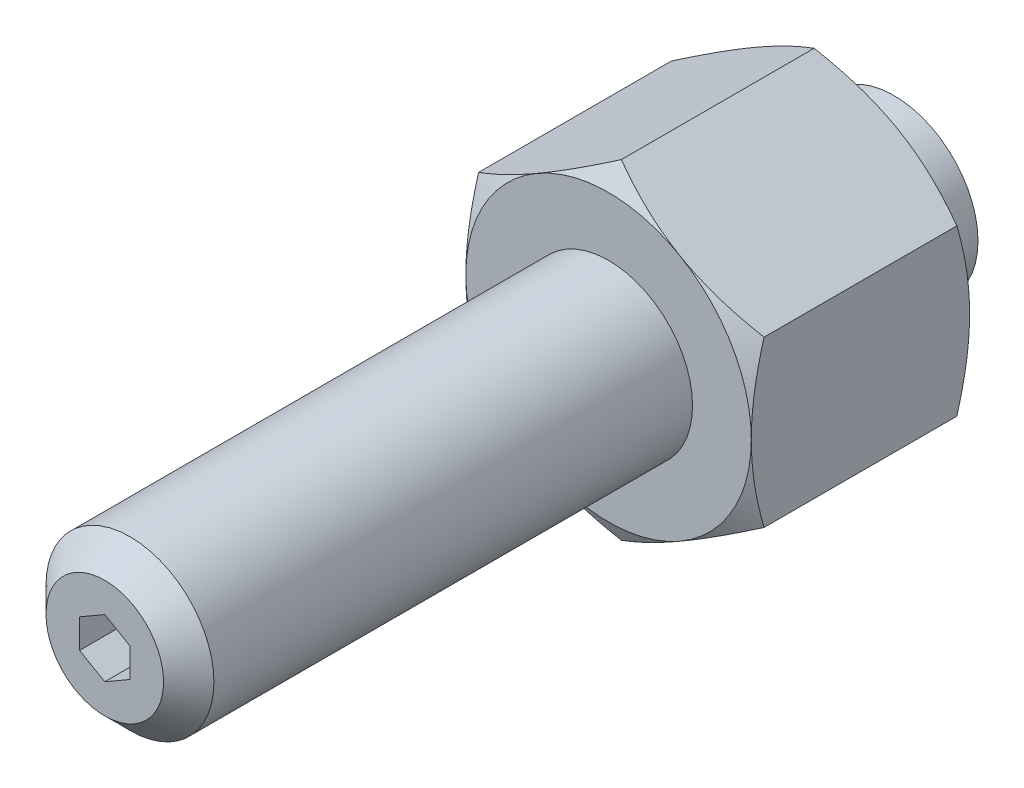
ISO-10303-21;
HEADER;
FILE_DESCRIPTION(('STEP AP214'),'2;1');
FILE_NAME('part.step','',(''),(''),'','','');
FILE_SCHEMA(('AUTOMOTIVE_DESIGN { 1 0 10303 214 1 1 1 1 }'));
ENDSEC;
DATA;
#1=APPLICATION_CONTEXT('core data for automotive mechanical design processes');
#2=APPLICATION_PROTOCOL_DEFINITION('international standard','automotive_design',2000,#1);
#3=PRODUCT_CONTEXT('',#1,'mechanical');
#4=PRODUCT('Part','Part','',(#3));
#5=PRODUCT_RELATED_PRODUCT_CATEGORY('part','',(#4));
#6=PRODUCT_DEFINITION_FORMATION('','',#4);
#7=PRODUCT_DEFINITION_CONTEXT('part definition',#1,'design');
#8=PRODUCT_DEFINITION('design','',#6,#7);
#9=PRODUCT_DEFINITION_SHAPE('','',#8);
#10=(LENGTH_UNIT() NAMED_UNIT(*) SI_UNIT(.MILLI.,.METRE.));
#11=(NAMED_UNIT(*) PLANE_ANGLE_UNIT() SI_UNIT($,.RADIAN.));
#12=(NAMED_UNIT(*) SI_UNIT($,.STERADIAN.) SOLID_ANGLE_UNIT());
#13=UNCERTAINTY_MEASURE_WITH_UNIT(LENGTH_MEASURE(1.E-05),#10,'distance_accuracy_value','');
#14=(GEOMETRIC_REPRESENTATION_CONTEXT(3) GLOBAL_UNCERTAINTY_ASSIGNED_CONTEXT((#13)) GLOBAL_UNIT_ASSIGNED_CONTEXT((#10,
#11,#12)) REPRESENTATION_CONTEXT('',''));
#15=CARTESIAN_POINT('',(0.,0.,0.));
#16=DIRECTION('',(0.,0.,1.));
#17=DIRECTION('',(1.,0.,0.));
#18=AXIS2_PLACEMENT_3D('',#15,#16,#17);
#19=CARTESIAN_POINT('',(0.,-9.81495457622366,57.));
#20=DIRECTION('',(-0.5,-0.866025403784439,0.));
#21=DIRECTION('',(-0.866025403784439,0.5,0.));
#22=AXIS2_PLACEMENT_3D('',#19,#20,#21);
#23=PLANE('',#22);
#24=DIRECTION('',(0.,0.,-1.));
#25=VECTOR('',#24,1.);
#26=CARTESIAN_POINT('',(-8.5,-4.90747728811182,57.));
#27=LINE('',#26,#25);
#28=CARTESIAN_POINT('',(-8.5,-4.90747728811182,16.2408106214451));
#29=VERTEX_POINT('',#28);
#30=CARTESIAN_POINT('',(-8.5,-4.90747728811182,4.75918937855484));
#31=VERTEX_POINT('',#30);
#32=EDGE_CURVE('E170',#29,#31,#27,.T.);
#33=ORIENTED_EDGE('',*,*,#32,.T.);
#34=CARTESIAN_POINT('',(-8.5002,-4.90736181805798,4.75925604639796));
#35=CARTESIAN_POINT('',(-8.31336077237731,-5.01523349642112,4.69698613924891));
#36=CARTESIAN_POINT('',(-8.1258249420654,-5.1235073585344,4.63754229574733));
#37=CARTESIAN_POINT('',(-7.74923024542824,-5.34093440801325,4.52508511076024));
#38=CARTESIAN_POINT('',(-7.56017075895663,-5.45008795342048,4.47207454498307));
#39=CARTESIAN_POINT('',(-6.9899652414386,-5.77929626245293,4.32373338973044));
#40=CARTESIAN_POINT('',(-6.60656835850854,-6.00065055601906,4.23935892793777));
#41=CARTESIAN_POINT('',(-6.03282233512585,-6.33190297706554,4.14042001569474));
#42=CARTESIAN_POINT('',(-5.84418723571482,-6.44081150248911,4.11223519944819));
#43=CARTESIAN_POINT('',(-5.4660639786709,-6.65912106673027,4.06497408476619));
#44=CARTESIAN_POINT('',(-5.27657589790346,-6.76852206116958,4.04589698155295));
#45=CARTESIAN_POINT('',(-4.8972734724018,-6.98751241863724,4.01733477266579));
#46=CARTESIAN_POINT('',(-4.70745974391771,-7.09710142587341,4.00783878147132));
#47=CARTESIAN_POINT('',(-4.32765694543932,-7.31638067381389,3.99864237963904));
#48=CARTESIAN_POINT('',(-4.13766788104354,-7.42607091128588,3.99894166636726));
#49=CARTESIAN_POINT('',(-3.78247698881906,-7.63114046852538,4.0086544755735));
#50=CARTESIAN_POINT('',(-3.6172500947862,-7.72653426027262,4.01688316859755));
#51=CARTESIAN_POINT('',(-3.28718328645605,-7.91709842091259,4.04058924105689));
#52=CARTESIAN_POINT('',(-3.12234339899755,-8.01226877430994,4.05606710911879));
#53=CARTESIAN_POINT('',(-2.62846189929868,-8.29741139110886,4.11300862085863));
#54=CARTESIAN_POINT('',(-2.30029449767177,-8.48687892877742,4.1649730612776));
#55=CARTESIAN_POINT('',(-1.64047857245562,-8.86782383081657,4.29488494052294));
#56=CARTESIAN_POINT('',(-1.30891425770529,-9.05925257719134,4.37338306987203));
#57=CARTESIAN_POINT('',(-0.650730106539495,-9.43925537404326,4.55154133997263));
#58=CARTESIAN_POINT('',(-0.324101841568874,-9.62783429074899,4.65115963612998));
#59=CARTESIAN_POINT('',(0.000200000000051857,-9.8150700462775,4.75925604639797));
#60=B_SPLINE_CURVE_WITH_KNOTS('',3,(#34,#35,#36,#37,#38,#39,#40,#41,#42,#43,#44,#45,#46,#47,#48,
#49,#50,#51,#52,#53,#54,#55,#56,#57,#58,#59),.UNSPECIFIED.,.F.,.F.,(4,2,2,2,2,2,2,2,2,2,2,2,4),
(0.,0.673596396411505,1.34748239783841,2.69805431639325,3.35679995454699,4.01548737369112,
4.67342558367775,5.33134346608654,5.90409556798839,6.47688628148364,7.62328361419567,
8.7951056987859,9.96462743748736),.UNSPECIFIED.);
#61=CARTESIAN_POINT('',(-4.25,-7.36121593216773,4.));
#62=VERTEX_POINT('',#61);
#63=EDGE_CURVE('E149',#31,#62,#60,.T.);
#64=ORIENTED_EDGE('',*,*,#63,.T.);
#65=CARTESIAN_POINT('',(0.,-9.81495457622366,4.75918937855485));
#66=VERTEX_POINT('',#65);
#67=EDGE_CURVE('E160',#62,#66,#60,.T.);
#68=ORIENTED_EDGE('',*,*,#67,.T.);
#69=DIRECTION('',(0.,0.,-1.));
#70=VECTOR('',#69,1.);
#71=CARTESIAN_POINT('',(0.,-9.81495457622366,57.));
#72=LINE('',#71,#70);
#73=CARTESIAN_POINT('',(0.,-9.81495457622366,16.2408106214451));
#74=VERTEX_POINT('',#73);
#75=EDGE_CURVE('E349',#74,#66,#72,.T.);
#76=ORIENTED_EDGE('',*,*,#75,.F.);
#77=CARTESIAN_POINT('',(0.000200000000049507,-9.8150700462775,16.240743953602));
#78=CARTESIAN_POINT('',(-0.186639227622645,-9.70719836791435,16.3030138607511));
#79=CARTESIAN_POINT('',(-0.374175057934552,-9.59892450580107,16.3624577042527));
#80=CARTESIAN_POINT('',(-0.750769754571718,-9.38149745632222,16.4749148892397));
#81=CARTESIAN_POINT('',(-0.939829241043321,-9.27234391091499,16.5279254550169));
#82=CARTESIAN_POINT('',(-1.51003475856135,-8.94313560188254,16.6762666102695));
#83=CARTESIAN_POINT('',(-1.89343164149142,-8.72178130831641,16.7606410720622));
#84=CARTESIAN_POINT('',(-2.46717766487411,-8.39052888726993,16.8595799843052));
#85=CARTESIAN_POINT('',(-2.65581276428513,-8.28162036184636,16.8877648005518));
#86=CARTESIAN_POINT('',(-3.03393602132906,-8.0633107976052,16.9350259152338));
#87=CARTESIAN_POINT('',(-3.22342410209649,-7.95390980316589,16.954103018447));
#88=CARTESIAN_POINT('',(-3.60272652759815,-7.73491944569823,16.9826652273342));
#89=CARTESIAN_POINT('',(-3.79254025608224,-7.62533043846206,16.9921612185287));
#90=CARTESIAN_POINT('',(-4.17234305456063,-7.40605119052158,17.0013576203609));
#91=CARTESIAN_POINT('',(-4.36233211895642,-7.29636095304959,17.0010583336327));
#92=CARTESIAN_POINT('',(-4.7175230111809,-7.09129139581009,16.9913455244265));
#93=CARTESIAN_POINT('',(-4.88274990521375,-6.99589760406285,16.9831168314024));
#94=CARTESIAN_POINT('',(-5.21281671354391,-6.80533344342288,16.9594107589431));
#95=CARTESIAN_POINT('',(-5.3776566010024,-6.71016309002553,16.9439328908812));
#96=CARTESIAN_POINT('',(-5.87153810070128,-6.42502047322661,16.8869913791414));
#97=CARTESIAN_POINT('',(-6.19970550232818,-6.23555293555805,16.8350269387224));
#98=CARTESIAN_POINT('',(-6.85952142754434,-5.8546080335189,16.7051150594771));
#99=CARTESIAN_POINT('',(-7.19108574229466,-5.66317928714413,16.626616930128));
#100=CARTESIAN_POINT('',(-7.84926989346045,-5.28317649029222,16.4484586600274));
#101=CARTESIAN_POINT('',(-8.17589815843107,-5.09459757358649,16.34884036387));
#102=CARTESIAN_POINT('',(-8.5002,-4.90736181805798,16.240743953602));
#103=B_SPLINE_CURVE_WITH_KNOTS('',3,(#77,#78,#79,#80,#81,#82,#83,#84,#85,#86,#87,#88,#89,#90,
#91,#92,#93,#94,#95,#96,#97,#98,#99,#100,#101,#102),.UNSPECIFIED.,.F.,.F.,(4,2,2,2,2,2,2,2,2,2,
2,2,4),(0.,0.673596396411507,1.34748239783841,2.69805431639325,3.35679995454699,
4.01548737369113,4.67342558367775,5.33134346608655,5.9040955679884,6.47688628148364,
7.62328361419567,8.79510569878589,9.96462743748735),.UNSPECIFIED.);
#104=CARTESIAN_POINT('',(-4.25,-7.36121593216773,17.));
#105=VERTEX_POINT('',#104);
#106=EDGE_CURVE('E347',#74,#105,#103,.T.);
#107=ORIENTED_EDGE('',*,*,#106,.T.);
#108=EDGE_CURVE('E235',#105,#29,#103,.T.);
#109=ORIENTED_EDGE('',*,*,#108,.T.);
#110=EDGE_LOOP('',(#33,#64,#68,#76,#107,#109));
#111=FACE_BOUND('',#110,.T.);
#112=ADVANCED_FACE('F14',(#111),#23,.T.);
#113=CARTESIAN_POINT('',(-8.5,-4.90747728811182,57.));
#114=DIRECTION('',(-1.,0.,0.));
#115=DIRECTION('',(0.,1.,0.));
#116=AXIS2_PLACEMENT_3D('',#113,#114,#115);
#117=PLANE('',#116);
#118=DIRECTION('',(0.,0.,-1.));
#119=VECTOR('',#118,1.);
#120=CARTESIAN_POINT('',(-8.5,4.90747728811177,57.));
#121=LINE('',#120,#119);
#122=CARTESIAN_POINT('',(-8.5,4.90747728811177,16.2408106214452));
#123=VERTEX_POINT('',#122);
#124=CARTESIAN_POINT('',(-8.5,4.90747728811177,4.75918937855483));
#125=VERTEX_POINT('',#124);
#126=EDGE_CURVE('E306',#123,#125,#121,.T.);
#127=ORIENTED_EDGE('',*,*,#126,.T.);
#128=CARTESIAN_POINT('',(-8.5,-13.1324885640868,8.12417549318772));
#129=CARTESIAN_POINT('',(-8.5,-12.7616566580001,7.94448876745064));
#130=CARTESIAN_POINT('',(-8.5,-12.3899681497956,7.76653934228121));
#131=CARTESIAN_POINT('',(-8.5,-11.6444221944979,7.41509317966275));
#132=CARTESIAN_POINT('',(-8.5,-11.2705644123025,7.24159715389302));
#133=CARTESIAN_POINT('',(-8.5,-10.5182739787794,6.89915235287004));
#134=CARTESIAN_POINT('',(-8.5,-10.1398274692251,6.73023391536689));
#135=CARTESIAN_POINT('',(-8.5,-9.37990713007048,6.3993761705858));
#136=CARTESIAN_POINT('',(-8.5,-8.9984334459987,6.23743653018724));
#137=CARTESIAN_POINT('',(-8.5,-8.21971888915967,5.91739408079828));
#138=CARTESIAN_POINT('',(-8.5,-7.82236092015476,5.75957459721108));
#139=CARTESIAN_POINT('',(-8.5,-7.0229787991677,5.45600050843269));
#140=CARTESIAN_POINT('',(-8.5,-6.620954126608,5.31024726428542));
#141=CARTESIAN_POINT('',(-8.5,-5.81236284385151,5.03466891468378));
#142=CARTESIAN_POINT('',(-8.5,-5.40580749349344,4.90481112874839));
#143=CARTESIAN_POINT('',(-8.5,-4.58688005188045,4.66522154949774));
#144=CARTESIAN_POINT('',(-8.5,-4.17450985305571,4.55548336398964));
#145=CARTESIAN_POINT('',(-8.5,-3.34593566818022,4.36202205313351));
#146=CARTESIAN_POINT('',(-8.5,-2.92976518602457,4.27815933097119));
#147=CARTESIAN_POINT('',(-8.5,-2.30175961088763,4.17542572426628));
#148=CARTESIAN_POINT('',(-8.5,-2.09178360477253,4.14502319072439));
#149=CARTESIAN_POINT('',(-8.5,-1.6708048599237,4.09250239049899));
#150=CARTESIAN_POINT('',(-8.5,-1.45980222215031,4.07038332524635));
#151=CARTESIAN_POINT('',(-8.5,-1.03978710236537,4.03514494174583));
#152=CARTESIAN_POINT('',(-8.5,-0.83078409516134,4.02191312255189));
#153=CARTESIAN_POINT('',(-8.5,-0.412406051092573,4.00429621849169));
#154=CARTESIAN_POINT('',(-8.5,-0.203031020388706,3.99991098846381));
#155=CARTESIAN_POINT('',(-8.5,0.215717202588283,4.0000917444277));
#156=CARTESIAN_POINT('',(-8.5,0.425090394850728,4.00465776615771));
#157=CARTESIAN_POINT('',(-8.5,0.843459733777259,4.02263027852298));
#158=CARTESIAN_POINT('',(-8.5,1.05245586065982,4.03603722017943));
#159=CARTESIAN_POINT('',(-8.5,1.55626341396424,4.07873030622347));
#160=CARTESIAN_POINT('',(-8.5,1.85071968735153,4.11229590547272));
#161=CARTESIAN_POINT('',(-8.5,2.43740008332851,4.19513347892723));
#162=CARTESIAN_POINT('',(-8.5,2.72962389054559,4.24440763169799));
#163=CARTESIAN_POINT('',(-8.5,3.60263968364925,4.41317610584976));
#164=CARTESIAN_POINT('',(-8.5,4.17943957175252,4.55358420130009));
#165=CARTESIAN_POINT('',(-8.5,5.04181763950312,4.79647070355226));
#166=CARTESIAN_POINT('',(-8.5,5.33188424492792,4.88392438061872));
#167=CARTESIAN_POINT('',(-8.5,5.90919926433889,5.06776823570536));
#168=CARTESIAN_POINT('',(-8.5,6.19644766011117,5.16415847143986));
#169=CARTESIAN_POINT('',(-8.5,6.76821920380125,5.36434118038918));
#170=CARTESIAN_POINT('',(-8.5,7.05274324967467,5.46813111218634));
#171=CARTESIAN_POINT('',(-8.5,7.61944420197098,5.68190672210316));
#172=CARTESIAN_POINT('',(-8.5,7.90162113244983,5.79189233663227));
#173=CARTESIAN_POINT('',(-8.5,8.55305577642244,6.05273121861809));
#174=CARTESIAN_POINT('',(-8.5,8.92155147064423,6.20548374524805));
#175=CARTESIAN_POINT('',(-8.5,9.65552104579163,6.51810382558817));
#176=CARTESIAN_POINT('',(-8.5,10.0209947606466,6.67797176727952));
#177=CARTESIAN_POINT('',(-8.5,10.7494636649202,7.00343821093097));
#178=CARTESIAN_POINT('',(-8.5,11.1124583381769,7.1690378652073));
#179=CARTESIAN_POINT('',(-8.5,11.8362963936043,7.50484563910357));
#180=CARTESIAN_POINT('',(-8.5,12.1971398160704,7.67505367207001));
#181=CARTESIAN_POINT('',(-8.5,12.9173873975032,8.0194128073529));
#182=CARTESIAN_POINT('',(-8.5,13.2767897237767,8.19356773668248));
#183=CARTESIAN_POINT('',(-8.5,13.9940659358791,8.54499997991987));
#184=CARTESIAN_POINT('',(-8.5,14.3519398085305,8.72227732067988));
#185=CARTESIAN_POINT('',(-8.5,15.4235374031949,9.25794018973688));
#186=CARTESIAN_POINT('',(-8.5,16.1353249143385,9.62019888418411));
#187=CARTESIAN_POINT('',(-8.5,17.4979242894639,10.3225631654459));
#188=CARTESIAN_POINT('',(-8.5,18.1490292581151,10.6621026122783));
#189=CARTESIAN_POINT('',(-8.5,19.4487945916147,11.3458754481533));
#190=CARTESIAN_POINT('',(-8.50000000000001,20.0974548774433,11.6901089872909));
#191=CARTESIAN_POINT('',(-8.50000000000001,21.3913382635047,12.3813547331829));
#192=CARTESIAN_POINT('',(-8.50000000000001,22.0365658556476,12.7283585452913));
#193=CARTESIAN_POINT('',(-8.50000000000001,23.3254488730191,13.4251952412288));
#194=CARTESIAN_POINT('',(-8.5,23.9691043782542,13.7750279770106));
#195=CARTESIAN_POINT('',(-8.5,24.612177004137,14.1259217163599));
#196=B_SPLINE_CURVE_WITH_KNOTS('',3,(#128,#129,#130,#131,#132,#133,#134,#135,#136,#137,#138,
#139,#140,#141,#142,#143,#144,#145,#146,#147,#148,#149,#150,#151,#152,#153,#154,#155,#156,#157,
#158,#159,#160,#161,#162,#163,#164,#165,#166,#167,#168,#169,#170,#171,#172,#173,#174,#175,#176,
#177,#178,#179,#180,#181,#182,#183,#184,#185,#186,#187,#188,#189,#190,#191,#192,#193,#194,#195),
.UNSPECIFIED.,.F.,.F.,(4,2,2,2,2,2,2,2,2,2,2,2,2,2,2,2,2,2,2,2,2,2,2,2,2,2,2,2,2,2,2,2,2,4),(0.,
1.23623238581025,2.47266111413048,3.7159054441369,4.95909036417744,6.24159305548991,
7.52424021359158,8.8042043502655,10.0837611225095,11.3562889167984,11.9926479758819,
12.6289456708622,13.2570287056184,13.8851014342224,14.5131766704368,15.1412839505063,
16.029870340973,16.9185800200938,18.6970088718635,19.605824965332,20.51464692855,
21.423158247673,22.3316602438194,23.5282656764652,24.7249364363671,25.9218491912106,
27.1187394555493,28.3168446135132,29.5149600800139,31.9108986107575,34.1138357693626,
36.3168435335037,38.5146924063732,40.7124269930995),.UNSPECIFIED.);
#197=CARTESIAN_POINT('',(-8.5,0.,4.));
#198=VERTEX_POINT('',#197);
#199=EDGE_CURVE('E289',#125,#198,#196,.F.);
#200=ORIENTED_EDGE('',*,*,#199,.T.);
#201=EDGE_CURVE('E151',#198,#31,#196,.F.);
#202=ORIENTED_EDGE('',*,*,#201,.T.);
#203=ORIENTED_EDGE('',*,*,#32,.F.);
#204=CARTESIAN_POINT('',(-8.5,-13.1324885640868,12.8758245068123));
#205=CARTESIAN_POINT('',(-8.5,-12.7616566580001,13.0555112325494));
#206=CARTESIAN_POINT('',(-8.5,-12.3899681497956,13.2334606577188));
#207=CARTESIAN_POINT('',(-8.5,-11.6444221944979,13.5849068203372));
#208=CARTESIAN_POINT('',(-8.5,-11.2705644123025,13.758402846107));
#209=CARTESIAN_POINT('',(-8.5,-10.5182739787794,14.10084764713));
#210=CARTESIAN_POINT('',(-8.5,-10.1398274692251,14.2697660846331));
#211=CARTESIAN_POINT('',(-8.5,-9.37990713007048,14.6006238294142));
#212=CARTESIAN_POINT('',(-8.5,-8.9984334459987,14.7625634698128));
#213=CARTESIAN_POINT('',(-8.5,-8.21971888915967,15.0826059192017));
#214=CARTESIAN_POINT('',(-8.5,-7.82236092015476,15.2404254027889));
#215=CARTESIAN_POINT('',(-8.5,-7.0229787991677,15.5439994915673));
#216=CARTESIAN_POINT('',(-8.5,-6.620954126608,15.6897527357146));
#217=CARTESIAN_POINT('',(-8.5,-5.81236284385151,15.9653310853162));
#218=CARTESIAN_POINT('',(-8.5,-5.40580749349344,16.0951888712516));
#219=CARTESIAN_POINT('',(-8.5,-4.58688005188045,16.3347784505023));
#220=CARTESIAN_POINT('',(-8.5,-4.17450985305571,16.4445166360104));
#221=CARTESIAN_POINT('',(-8.5,-3.34593566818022,16.6379779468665));
#222=CARTESIAN_POINT('',(-8.5,-2.92976518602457,16.7218406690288));
#223=CARTESIAN_POINT('',(-8.5,-2.30175961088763,16.8245742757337));
#224=CARTESIAN_POINT('',(-8.5,-2.09178360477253,16.8549768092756));
#225=CARTESIAN_POINT('',(-8.5,-1.6708048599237,16.907497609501));
#226=CARTESIAN_POINT('',(-8.5,-1.45980222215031,16.9296166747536));
#227=CARTESIAN_POINT('',(-8.5,-1.03978710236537,16.9648550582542));
#228=CARTESIAN_POINT('',(-8.5,-0.830784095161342,16.9780868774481));
#229=CARTESIAN_POINT('',(-8.5,-0.412406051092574,16.9957037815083));
#230=CARTESIAN_POINT('',(-8.5,-0.203031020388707,17.0000890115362));
#231=CARTESIAN_POINT('',(-8.5,0.215717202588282,16.9999082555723));
#232=CARTESIAN_POINT('',(-8.5,0.425090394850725,16.9953422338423));
#233=CARTESIAN_POINT('',(-8.5,0.843459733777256,16.977369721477));
#234=CARTESIAN_POINT('',(-8.5,1.05245586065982,16.9639627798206));
#235=CARTESIAN_POINT('',(-8.5,1.55626341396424,16.9212696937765));
#236=CARTESIAN_POINT('',(-8.5,1.85071968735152,16.8877040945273));
#237=CARTESIAN_POINT('',(-8.5,2.4374000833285,16.8048665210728));
#238=CARTESIAN_POINT('',(-8.5,2.72962389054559,16.755592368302));
#239=CARTESIAN_POINT('',(-8.5,3.60263968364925,16.5868238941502));
#240=CARTESIAN_POINT('',(-8.5,4.17943957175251,16.4464157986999));
#241=CARTESIAN_POINT('',(-8.5,5.04181763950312,16.2035292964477));
#242=CARTESIAN_POINT('',(-8.5,5.33188424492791,16.1160756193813));
#243=CARTESIAN_POINT('',(-8.5,5.90919926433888,15.9322317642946));
#244=CARTESIAN_POINT('',(-8.5,6.19644766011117,15.8358415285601));
#245=CARTESIAN_POINT('',(-8.5,6.76821920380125,15.6356588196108));
#246=CARTESIAN_POINT('',(-8.5,7.05274324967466,15.5318688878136));
#247=CARTESIAN_POINT('',(-8.5,7.61944420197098,15.3180932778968));
#248=CARTESIAN_POINT('',(-8.5,7.90162113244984,15.2081076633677));
#249=CARTESIAN_POINT('',(-8.5,8.55305577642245,14.9472687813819));
#250=CARTESIAN_POINT('',(-8.5,8.92155147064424,14.7945162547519));
#251=CARTESIAN_POINT('',(-8.5,9.65552104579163,14.4818961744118));
#252=CARTESIAN_POINT('',(-8.5,10.0209947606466,14.3220282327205));
#253=CARTESIAN_POINT('',(-8.5,10.7494636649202,13.996561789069));
#254=CARTESIAN_POINT('',(-8.5,11.1124583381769,13.8309621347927));
#255=CARTESIAN_POINT('',(-8.5,11.8362963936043,13.4951543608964));
#256=CARTESIAN_POINT('',(-8.5,12.1971398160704,13.32494632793));
#257=CARTESIAN_POINT('',(-8.5,12.9173873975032,12.9805871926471));
#258=CARTESIAN_POINT('',(-8.5,13.2767897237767,12.8064322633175));
#259=CARTESIAN_POINT('',(-8.5,13.9940659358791,12.4550000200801));
#260=CARTESIAN_POINT('',(-8.5,14.3519398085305,12.2777226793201));
#261=CARTESIAN_POINT('',(-8.5,15.4235374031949,11.7420598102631));
#262=CARTESIAN_POINT('',(-8.5,16.1353249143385,11.3798011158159));
#263=CARTESIAN_POINT('',(-8.5,17.4979242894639,10.6774368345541));
#264=CARTESIAN_POINT('',(-8.5,18.1490292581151,10.3378973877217));
#265=CARTESIAN_POINT('',(-8.5,19.4487945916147,9.65412455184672));
#266=CARTESIAN_POINT('',(-8.50000000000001,20.0974548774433,9.30989101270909));
#267=CARTESIAN_POINT('',(-8.50000000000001,21.3913382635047,8.61864526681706));
#268=CARTESIAN_POINT('',(-8.50000000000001,22.0365658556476,8.27164145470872));
#269=CARTESIAN_POINT('',(-8.50000000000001,23.3254488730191,7.57480475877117));
#270=CARTESIAN_POINT('',(-8.5,23.9691043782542,7.22497202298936));
#271=CARTESIAN_POINT('',(-8.5,24.612177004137,6.87407828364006));
#272=B_SPLINE_CURVE_WITH_KNOTS('',3,(#204,#205,#206,#207,#208,#209,#210,#211,#212,#213,#214,
#215,#216,#217,#218,#219,#220,#221,#222,#223,#224,#225,#226,#227,#228,#229,#230,#231,#232,#233,
#234,#235,#236,#237,#238,#239,#240,#241,#242,#243,#244,#245,#246,#247,#248,#249,#250,#251,#252,
#253,#254,#255,#256,#257,#258,#259,#260,#261,#262,#263,#264,#265,#266,#267,#268,#269,#270,#271),
.UNSPECIFIED.,.F.,.F.,(4,2,2,2,2,2,2,2,2,2,2,2,2,2,2,2,2,2,2,2,2,2,2,2,2,2,2,2,2,2,2,2,2,4),(0.,
1.23623238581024,2.47266111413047,3.71590544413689,4.95909036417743,6.2415930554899,
7.52424021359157,8.80420435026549,10.0837611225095,11.3562889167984,11.9926479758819,
12.6289456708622,13.2570287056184,13.8851014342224,14.5131766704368,15.1412839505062,
16.029870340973,16.9185800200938,18.6970088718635,19.6058249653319,20.51464692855,
21.423158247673,22.3316602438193,23.5282656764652,24.7249364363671,25.9218491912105,
27.1187394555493,28.3168446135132,29.5149600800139,31.9108986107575,34.1138357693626,
36.3168435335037,38.5146924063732,40.7124269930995),.UNSPECIFIED.);
#273=CARTESIAN_POINT('',(-8.5,0.,17.));
#274=VERTEX_POINT('',#273);
#275=EDGE_CURVE('E245',#29,#274,#272,.T.);
#276=ORIENTED_EDGE('',*,*,#275,.T.);
#277=EDGE_CURVE('E265',#274,#123,#272,.T.);
#278=ORIENTED_EDGE('',*,*,#277,.T.);
#279=EDGE_LOOP('',(#127,#200,#202,#203,#276,#278));
#280=FACE_BOUND('',#279,.T.);
#281=ADVANCED_FACE('F269',(#280),#117,.T.);
#282=CARTESIAN_POINT('',(0.,9.81495457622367,57.));
#283=DIRECTION('',(0.500000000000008,-0.866025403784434,0.));
#284=DIRECTION('',(-0.866025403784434,-0.500000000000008,0.));
#285=AXIS2_PLACEMENT_3D('',#282,#283,#284);
#286=PLANE('',#285);
#287=CARTESIAN_POINT('',(-8.5002,4.90736181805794,4.75925604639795));
#288=CARTESIAN_POINT('',(-8.31336077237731,5.01523349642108,4.6969861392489));
#289=CARTESIAN_POINT('',(-8.1258249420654,5.12350735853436,4.63754229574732));
#290=CARTESIAN_POINT('',(-7.74923024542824,5.34093440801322,4.52508511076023));
#291=CARTESIAN_POINT('',(-7.56017075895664,5.45008795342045,4.47207454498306));
#292=CARTESIAN_POINT('',(-6.98996524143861,5.7792962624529,4.32373338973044));
#293=CARTESIAN_POINT('',(-6.60656835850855,6.00065055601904,4.23935892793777));
#294=CARTESIAN_POINT('',(-6.03282233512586,6.33190297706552,4.14042001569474));
#295=CARTESIAN_POINT('',(-5.84418723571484,6.44081150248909,4.11223519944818));
#296=CARTESIAN_POINT('',(-5.46606397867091,6.65912106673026,4.06497408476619));
#297=CARTESIAN_POINT('',(-5.27657589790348,6.76852206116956,4.04589698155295));
#298=CARTESIAN_POINT('',(-4.89727347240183,6.98751241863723,4.01733477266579));
#299=CARTESIAN_POINT('',(-4.70745974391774,7.09710142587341,4.00783878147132));
#300=CARTESIAN_POINT('',(-4.32765694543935,7.31638067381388,3.99864237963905));
#301=CARTESIAN_POINT('',(-4.13766788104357,7.42607091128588,3.99894166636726));
#302=CARTESIAN_POINT('',(-3.78247698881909,7.63114046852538,4.00865447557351));
#303=CARTESIAN_POINT('',(-3.61725009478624,7.72653426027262,4.01688316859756));
#304=CARTESIAN_POINT('',(-3.28718328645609,7.9170984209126,4.0405892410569));
#305=CARTESIAN_POINT('',(-3.1223433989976,8.01226877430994,4.0560671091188));
#306=CARTESIAN_POINT('',(-2.62846189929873,8.29741139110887,4.11300862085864));
#307=CARTESIAN_POINT('',(-2.30029449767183,8.48687892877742,4.16497306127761));
#308=CARTESIAN_POINT('',(-1.64047857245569,8.86782383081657,4.29488494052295));
#309=CARTESIAN_POINT('',(-1.30891425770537,9.05925257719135,4.37338306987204));
#310=CARTESIAN_POINT('',(-0.650730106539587,9.43925537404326,4.55154133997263));
#311=CARTESIAN_POINT('',(-0.324101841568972,9.62783429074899,4.65115963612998));
#312=CARTESIAN_POINT('',(0.000199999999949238,9.8150700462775,4.75925604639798));
#313=B_SPLINE_CURVE_WITH_KNOTS('',3,(#287,#288,#289,#290,#291,#292,#293,#294,#295,#296,#297,
#298,#299,#300,#301,#302,#303,#304,#305,#306,#307,#308,#309,#310,#311,#312),.UNSPECIFIED.,.F.,
.F.,(4,2,2,2,2,2,2,2,2,2,2,2,4),(0.,0.673596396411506,1.34748239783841,2.69805431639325,
3.35679995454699,4.01548737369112,4.67342558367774,5.33134346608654,5.90409556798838,
6.47688628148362,7.62328361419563,8.79510569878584,9.96462743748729),.UNSPECIFIED.);
#314=CARTESIAN_POINT('',(-4.25000000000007,7.3612159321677,4.));
#315=VERTEX_POINT('',#314);
#316=EDGE_CURVE('E280',#125,#315,#313,.T.);
#317=ORIENTED_EDGE('',*,*,#316,.F.);
#318=ORIENTED_EDGE('',*,*,#126,.F.);
#319=CARTESIAN_POINT('',(0.00019999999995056,9.81507004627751,16.240743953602));
#320=CARTESIAN_POINT('',(-0.186639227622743,9.70719836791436,16.3030138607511));
#321=CARTESIAN_POINT('',(-0.374175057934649,9.59892450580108,16.3624577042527));
#322=CARTESIAN_POINT('',(-0.750769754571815,9.38149745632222,16.4749148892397));
#323=CARTESIAN_POINT('',(-0.939829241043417,9.27234391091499,16.5279254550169));
#324=CARTESIAN_POINT('',(-1.51003475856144,8.94313560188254,16.6762666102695));
#325=CARTESIAN_POINT('',(-1.89343164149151,8.72178130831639,16.7606410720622));
#326=CARTESIAN_POINT('',(-2.4671776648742,8.39052888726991,16.8595799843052));
#327=CARTESIAN_POINT('',(-2.65581276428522,8.28162036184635,16.8877648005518));
#328=CARTESIAN_POINT('',(-3.03393602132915,8.06331079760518,16.9350259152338));
#329=CARTESIAN_POINT('',(-3.22342410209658,7.95390980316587,16.954103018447));
#330=CARTESIAN_POINT('',(-3.60272652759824,7.73491944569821,16.9826652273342));
#331=CARTESIAN_POINT('',(-3.79254025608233,7.62533043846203,16.9921612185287));
#332=CARTESIAN_POINT('',(-4.17234305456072,7.40605119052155,17.0013576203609));
#333=CARTESIAN_POINT('',(-4.3623321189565,7.29636095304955,17.0010583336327));
#334=CARTESIAN_POINT('',(-4.71752301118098,7.09129139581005,16.9913455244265));
#335=CARTESIAN_POINT('',(-4.88274990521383,6.99589760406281,16.9831168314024));
#336=CARTESIAN_POINT('',(-5.21281671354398,6.80533344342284,16.9594107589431));
#337=CARTESIAN_POINT('',(-5.37765660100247,6.71016309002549,16.9439328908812));
#338=CARTESIAN_POINT('',(-5.87153810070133,6.42502047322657,16.8869913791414));
#339=CARTESIAN_POINT('',(-6.19970550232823,6.23555293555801,16.8350269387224));
#340=CARTESIAN_POINT('',(-6.85952142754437,5.85460803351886,16.7051150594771));
#341=CARTESIAN_POINT('',(-7.19108574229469,5.66317928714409,16.626616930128));
#342=CARTESIAN_POINT('',(-7.84926989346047,5.28317649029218,16.4484586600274));
#343=CARTESIAN_POINT('',(-8.17589815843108,5.09459757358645,16.34884036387));
#344=CARTESIAN_POINT('',(-8.5002,4.90736181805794,16.240743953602));
#345=B_SPLINE_CURVE_WITH_KNOTS('',3,(#319,#320,#321,#322,#323,#324,#325,#326,#327,#328,#329,
#330,#331,#332,#333,#334,#335,#336,#337,#338,#339,#340,#341,#342,#343,#344),.UNSPECIFIED.,.F.,
.F.,(4,2,2,2,2,2,2,2,2,2,2,2,4),(0.,0.673596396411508,1.34748239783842,2.69805431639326,
3.356799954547,4.01548737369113,4.67342558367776,5.33134346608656,5.9040955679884,
6.47688628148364,7.62328361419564,8.79510569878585,9.96462743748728),.UNSPECIFIED.);
#346=CARTESIAN_POINT('',(-4.25000000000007,7.3612159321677,17.));
#347=VERTEX_POINT('',#346);
#348=EDGE_CURVE('E259',#347,#123,#345,.T.);
#349=ORIENTED_EDGE('',*,*,#348,.F.);
#350=CARTESIAN_POINT('',(0.,9.81495457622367,16.2408106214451));
#351=VERTEX_POINT('',#350);
#352=EDGE_CURVE('E264',#351,#347,#345,.T.);
#353=ORIENTED_EDGE('',*,*,#352,.F.);
#354=DIRECTION('',(0.,0.,-1.));
#355=VECTOR('',#354,1.);
#356=CARTESIAN_POINT('',(0.,9.81495457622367,57.));
#357=LINE('',#356,#355);
#358=CARTESIAN_POINT('',(0.,9.81495457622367,4.75918937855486));
#359=VERTEX_POINT('',#358);
#360=EDGE_CURVE('E314',#351,#359,#357,.T.);
#361=ORIENTED_EDGE('',*,*,#360,.T.);
#362=EDGE_CURVE('E274',#315,#359,#313,.T.);
#363=ORIENTED_EDGE('',*,*,#362,.F.);
#364=EDGE_LOOP('',(#317,#318,#349,#353,#361,#363));
#365=FACE_BOUND('',#364,.T.);
#366=ADVANCED_FACE('F266',(#365),#286,.F.);
#367=CARTESIAN_POINT('',(0.,9.81495457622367,57.));
#368=DIRECTION('',(0.5,0.866025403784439,0.));
#369=DIRECTION('',(0.866025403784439,-0.5,0.));
#370=AXIS2_PLACEMENT_3D('',#367,#368,#369);
#371=PLANE('',#370);
#372=DIRECTION('',(0.,0.,-1.));
#373=VECTOR('',#372,1.);
#374=CARTESIAN_POINT('',(8.5,4.90747728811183,57.));
#375=LINE('',#374,#373);
#376=CARTESIAN_POINT('',(8.5,4.90747728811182,16.2408106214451));
#377=VERTEX_POINT('',#376);
#378=CARTESIAN_POINT('',(8.5,4.90747728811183,4.75918937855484));
#379=VERTEX_POINT('',#378);
#380=EDGE_CURVE('E326',#377,#379,#375,.T.);
#381=ORIENTED_EDGE('',*,*,#380,.T.);
#382=CARTESIAN_POINT('',(8.5002,4.90736181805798,4.75925604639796));
#383=CARTESIAN_POINT('',(8.31336077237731,5.01523349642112,4.69698613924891));
#384=CARTESIAN_POINT('',(8.1258249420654,5.1235073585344,4.63754229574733));
#385=CARTESIAN_POINT('',(7.74923024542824,5.34093440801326,4.52508511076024));
#386=CARTESIAN_POINT('',(7.56017075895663,5.45008795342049,4.47207454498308));
#387=CARTESIAN_POINT('',(6.9899652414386,5.77929626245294,4.32373338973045));
#388=CARTESIAN_POINT('',(6.60656835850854,6.00065055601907,4.23935892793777));
#389=CARTESIAN_POINT('',(6.03282233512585,6.33190297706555,4.14042001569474));
#390=CARTESIAN_POINT('',(5.84418723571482,6.44081150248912,4.11223519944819));
#391=CARTESIAN_POINT('',(5.4660639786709,6.65912106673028,4.06497408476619));
#392=CARTESIAN_POINT('',(5.27657589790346,6.76852206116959,4.04589698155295));
#393=CARTESIAN_POINT('',(4.8972734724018,6.98751241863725,4.0173347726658));
#394=CARTESIAN_POINT('',(4.70745974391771,7.09710142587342,4.00783878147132));
#395=CARTESIAN_POINT('',(4.32765694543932,7.3163806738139,3.99864237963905));
#396=CARTESIAN_POINT('',(4.13766788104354,7.42607091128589,3.99894166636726));
#397=CARTESIAN_POINT('',(3.78247698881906,7.63114046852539,4.00865447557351));
#398=CARTESIAN_POINT('',(3.6172500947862,7.72653426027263,4.01688316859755));
#399=CARTESIAN_POINT('',(3.28718328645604,7.91709842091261,4.0405892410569));
#400=CARTESIAN_POINT('',(3.12234339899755,8.01226877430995,4.0560671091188));
#401=CARTESIAN_POINT('',(2.62846189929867,8.29741139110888,4.11300862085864));
#402=CARTESIAN_POINT('',(2.30029449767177,8.48687892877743,4.16497306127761));
#403=CARTESIAN_POINT('',(1.64047857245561,8.86782383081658,4.29488494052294));
#404=CARTESIAN_POINT('',(1.30891425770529,9.05925257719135,4.37338306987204));
#405=CARTESIAN_POINT('',(0.650730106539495,9.43925537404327,4.55154133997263));
#406=CARTESIAN_POINT('',(0.324101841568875,9.627834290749,4.65115963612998));
#407=CARTESIAN_POINT('',(-0.000200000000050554,9.81507004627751,4.75925604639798));
#408=B_SPLINE_CURVE_WITH_KNOTS('',3,(#382,#383,#384,#385,#386,#387,#388,#389,#390,#391,#392,
#393,#394,#395,#396,#397,#398,#399,#400,#401,#402,#403,#404,#405,#406,#407),.UNSPECIFIED.,.F.,
.F.,(4,2,2,2,2,2,2,2,2,2,2,2,4),(0.,0.673596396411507,1.34748239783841,2.69805431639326,
3.35679995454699,4.01548737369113,4.67342558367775,5.33134346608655,5.9040955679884,
6.47688628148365,7.62328361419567,8.7951056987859,9.96462743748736),.UNSPECIFIED.);
#409=CARTESIAN_POINT('',(4.25,7.36121593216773,4.));
#410=VERTEX_POINT('',#409);
#411=EDGE_CURVE('E165',#379,#410,#408,.T.);
#412=ORIENTED_EDGE('',*,*,#411,.T.);
#413=EDGE_CURVE('E171',#410,#359,#408,.T.);
#414=ORIENTED_EDGE('',*,*,#413,.T.);
#415=ORIENTED_EDGE('',*,*,#360,.F.);
#416=CARTESIAN_POINT('',(-0.000200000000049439,9.81507004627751,16.240743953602));
#417=CARTESIAN_POINT('',(0.186639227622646,9.70719836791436,16.3030138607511));
#418=CARTESIAN_POINT('',(0.374175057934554,9.59892450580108,16.3624577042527));
#419=CARTESIAN_POINT('',(0.750769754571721,9.38149745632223,16.4749148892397));
#420=CARTESIAN_POINT('',(0.939829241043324,9.27234391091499,16.5279254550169));
#421=CARTESIAN_POINT('',(1.51003475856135,8.94313560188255,16.6762666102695));
#422=CARTESIAN_POINT('',(1.89343164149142,8.72178130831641,16.7606410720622));
#423=CARTESIAN_POINT('',(2.46717766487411,8.39052888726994,16.8595799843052));
#424=CARTESIAN_POINT('',(2.65581276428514,8.28162036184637,16.8877648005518));
#425=CARTESIAN_POINT('',(3.03393602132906,8.0633107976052,16.9350259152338));
#426=CARTESIAN_POINT('',(3.2234241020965,7.9539098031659,16.954103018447));
#427=CARTESIAN_POINT('',(3.60272652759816,7.73491944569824,16.9826652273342));
#428=CARTESIAN_POINT('',(3.79254025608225,7.62533043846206,16.9921612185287));
#429=CARTESIAN_POINT('',(4.17234305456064,7.40605119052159,17.0013576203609));
#430=CARTESIAN_POINT('',(4.36233211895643,7.2963609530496,17.0010583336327));
#431=CARTESIAN_POINT('',(4.71752301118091,7.0912913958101,16.9913455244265));
#432=CARTESIAN_POINT('',(4.88274990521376,6.99589760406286,16.9831168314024));
#433=CARTESIAN_POINT('',(5.21281671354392,6.80533344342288,16.9594107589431));
#434=CARTESIAN_POINT('',(5.37765660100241,6.71016309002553,16.9439328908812));
#435=CARTESIAN_POINT('',(5.87153810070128,6.42502047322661,16.8869913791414));
#436=CARTESIAN_POINT('',(6.19970550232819,6.23555293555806,16.8350269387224));
#437=CARTESIAN_POINT('',(6.85952142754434,5.85460803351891,16.7051150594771));
#438=CARTESIAN_POINT('',(7.19108574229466,5.66317928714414,16.626616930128));
#439=CARTESIAN_POINT('',(7.84926989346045,5.28317649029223,16.4484586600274));
#440=CARTESIAN_POINT('',(8.17589815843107,5.0945975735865,16.34884036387));
#441=CARTESIAN_POINT('',(8.5002,4.90736181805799,16.240743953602));
#442=B_SPLINE_CURVE_WITH_KNOTS('',3,(#416,#417,#418,#419,#420,#421,#422,#423,#424,#425,#426,
#427,#428,#429,#430,#431,#432,#433,#434,#435,#436,#437,#438,#439,#440,#441),.UNSPECIFIED.,.F.,
.F.,(4,2,2,2,2,2,2,2,2,2,2,2,4),(0.,0.673596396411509,1.34748239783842,2.69805431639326,
3.356799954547,4.01548737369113,4.67342558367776,5.33134346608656,5.90409556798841,
6.47688628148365,7.62328361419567,8.79510569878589,9.96462743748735),.UNSPECIFIED.);
#443=CARTESIAN_POINT('',(4.25,7.36121593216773,17.));
#444=VERTEX_POINT('',#443);
#445=EDGE_CURVE('E215',#351,#444,#442,.T.);
#446=ORIENTED_EDGE('',*,*,#445,.T.);
#447=EDGE_CURVE('E214',#444,#377,#442,.T.);
#448=ORIENTED_EDGE('',*,*,#447,.T.);
#449=EDGE_LOOP('',(#381,#412,#414,#415,#446,#448));
#450=FACE_BOUND('',#449,.T.);
#451=ADVANCED_FACE('F199',(#450),#371,.T.);
#452=CARTESIAN_POINT('',(8.5,-4.90747728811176,57.));
#453=DIRECTION('',(-1.,0.,0.));
#454=DIRECTION('',(0.,0.,-1.));
#455=AXIS2_PLACEMENT_3D('',#452,#453,#454);
#456=PLANE('',#455);
#457=CARTESIAN_POINT('',(8.5,-13.1324885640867,8.12417549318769));
#458=CARTESIAN_POINT('',(8.5,-12.761656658,7.9444887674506));
#459=CARTESIAN_POINT('',(8.5,-12.3899681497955,7.76653934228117));
#460=CARTESIAN_POINT('',(8.5,-11.6444221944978,7.41509317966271));
#461=CARTESIAN_POINT('',(8.5,-11.2705644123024,7.24159715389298));
#462=CARTESIAN_POINT('',(8.5,-10.5182739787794,6.89915235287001));
#463=CARTESIAN_POINT('',(8.5,-10.139827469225,6.73023391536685));
#464=CARTESIAN_POINT('',(8.5,-9.3799071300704,6.39937617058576));
#465=CARTESIAN_POINT('',(8.5,-8.99843344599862,6.2374365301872));
#466=CARTESIAN_POINT('',(8.5,-8.2197188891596,5.91739408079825));
#467=CARTESIAN_POINT('',(8.5,-7.82236092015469,5.75957459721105));
#468=CARTESIAN_POINT('',(8.5,-7.02297879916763,5.45600050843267));
#469=CARTESIAN_POINT('',(8.5,-6.62095412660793,5.3102472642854));
#470=CARTESIAN_POINT('',(8.5,-5.81236284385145,5.03466891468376));
#471=CARTESIAN_POINT('',(8.5,-5.40580749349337,4.90481112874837));
#472=CARTESIAN_POINT('',(8.5,-4.58688005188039,4.66522154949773));
#473=CARTESIAN_POINT('',(8.5,-4.17450985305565,4.55548336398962));
#474=CARTESIAN_POINT('',(8.5,-3.34593566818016,4.36202205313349));
#475=CARTESIAN_POINT('',(8.5,-2.92976518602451,4.27815933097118));
#476=CARTESIAN_POINT('',(8.5,-2.30175961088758,4.17542572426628));
#477=CARTESIAN_POINT('',(8.5,-2.09178360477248,4.14502319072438));
#478=CARTESIAN_POINT('',(8.5,-1.67080485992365,4.09250239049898));
#479=CARTESIAN_POINT('',(8.5,-1.45980222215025,4.07038332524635));
#480=CARTESIAN_POINT('',(8.5,-1.03978710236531,4.03514494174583));
#481=CARTESIAN_POINT('',(8.5,-0.830784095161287,4.02191312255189));
#482=CARTESIAN_POINT('',(8.5,-0.412406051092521,4.00429621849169));
#483=CARTESIAN_POINT('',(8.5,-0.203031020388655,3.99991098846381));
#484=CARTESIAN_POINT('',(8.5,0.215717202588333,4.0000917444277));
#485=CARTESIAN_POINT('',(8.5,0.425090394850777,4.00465776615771));
#486=CARTESIAN_POINT('',(8.5,0.843459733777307,4.02263027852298));
#487=CARTESIAN_POINT('',(8.5,1.05245586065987,4.03603722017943));
#488=CARTESIAN_POINT('',(8.5,1.55626341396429,4.07873030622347));
#489=CARTESIAN_POINT('',(8.5,1.85071968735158,4.11229590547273));
#490=CARTESIAN_POINT('',(8.5,2.43740008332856,4.19513347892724));
#491=CARTESIAN_POINT('',(8.5,2.72962389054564,4.244407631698));
#492=CARTESIAN_POINT('',(8.5,3.60263968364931,4.41317610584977));
#493=CARTESIAN_POINT('',(8.5,4.17943957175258,4.5535842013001));
#494=CARTESIAN_POINT('',(8.5,5.04181763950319,4.79647070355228));
#495=CARTESIAN_POINT('',(8.5,5.33188424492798,4.88392438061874));
#496=CARTESIAN_POINT('',(8.5,5.90919926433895,5.06776823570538));
#497=CARTESIAN_POINT('',(8.5,6.19644766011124,5.16415847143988));
#498=CARTESIAN_POINT('',(8.5,6.76821920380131,5.36434118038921));
#499=CARTESIAN_POINT('',(8.5,7.05274324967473,5.46813111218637));
#500=CARTESIAN_POINT('',(8.5,7.61944420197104,5.68190672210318));
#501=CARTESIAN_POINT('',(8.5,7.9016211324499,5.7918923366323));
#502=CARTESIAN_POINT('',(8.5,8.55305577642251,6.05273121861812));
#503=CARTESIAN_POINT('',(8.5,8.92155147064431,6.20548374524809));
#504=CARTESIAN_POINT('',(8.5,9.65552104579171,6.5181038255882));
#505=CARTESIAN_POINT('',(8.5,10.0209947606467,6.67797176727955));
#506=CARTESIAN_POINT('',(8.5,10.7494636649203,7.003438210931));
#507=CARTESIAN_POINT('',(8.5,11.112458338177,7.16903786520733));
#508=CARTESIAN_POINT('',(8.5,11.8362963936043,7.5048456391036));
#509=CARTESIAN_POINT('',(8.5,12.1971398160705,7.67505367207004));
#510=CARTESIAN_POINT('',(8.5,12.9173873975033,8.01941280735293));
#511=CARTESIAN_POINT('',(8.5,13.2767897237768,8.19356773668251));
#512=CARTESIAN_POINT('',(8.5,13.9940659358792,8.5449999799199));
#513=CARTESIAN_POINT('',(8.5,14.3519398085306,8.72227732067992));
#514=CARTESIAN_POINT('',(8.5,15.423537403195,9.25794018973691));
#515=CARTESIAN_POINT('',(8.5,16.1353249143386,9.62019888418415));
#516=CARTESIAN_POINT('',(8.5,17.497924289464,10.322563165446));
#517=CARTESIAN_POINT('',(8.5,18.1490292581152,10.6621026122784));
#518=CARTESIAN_POINT('',(8.5,19.4487945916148,11.3458754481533));
#519=CARTESIAN_POINT('',(8.5,20.0974548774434,11.6901089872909));
#520=CARTESIAN_POINT('',(8.5,21.3913382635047,12.381354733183));
#521=CARTESIAN_POINT('',(8.5,22.0365658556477,12.7283585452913));
#522=CARTESIAN_POINT('',(8.5,23.3254488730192,13.4251952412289));
#523=CARTESIAN_POINT('',(8.5,23.9691043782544,13.7750279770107));
#524=CARTESIAN_POINT('',(8.5,24.6121770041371,14.12592171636));
#525=B_SPLINE_CURVE_WITH_KNOTS('',3,(#457,#458,#459,#460,#461,#462,#463,#464,#465,#466,#467,
#468,#469,#470,#471,#472,#473,#474,#475,#476,#477,#478,#479,#480,#481,#482,#483,#484,#485,#486,
#487,#488,#489,#490,#491,#492,#493,#494,#495,#496,#497,#498,#499,#500,#501,#502,#503,#504,#505,
#506,#507,#508,#509,#510,#511,#512,#513,#514,#515,#516,#517,#518,#519,#520,#521,#522,#523,#524),
.UNSPECIFIED.,.F.,.F.,(4,2,2,2,2,2,2,2,2,2,2,2,2,2,2,2,2,2,2,2,2,2,2,2,2,2,2,2,2,2,2,2,2,4),(0.,
1.23623238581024,2.47266111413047,3.71590544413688,4.95909036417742,6.24159305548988,
7.52424021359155,8.80420435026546,10.0837611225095,11.3562889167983,11.9926479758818,
12.6289456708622,13.2570287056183,13.8851014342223,14.5131766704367,15.1412839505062,
16.029870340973,16.9185800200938,18.6970088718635,19.6058249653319,20.51464692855,
21.4231582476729,22.3316602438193,23.5282656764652,24.7249364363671,25.9218491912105,
27.1187394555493,28.3168446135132,29.5149600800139,31.9108986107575,34.1138357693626,
36.3168435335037,38.5146924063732,40.7124269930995),.UNSPECIFIED.);
#526=CARTESIAN_POINT('',(8.5,0.,4.));
#527=VERTEX_POINT('',#526);
#528=EDGE_CURVE('E185',#379,#527,#525,.F.);
#529=ORIENTED_EDGE('',*,*,#528,.F.);
#530=ORIENTED_EDGE('',*,*,#380,.F.);
#531=CARTESIAN_POINT('',(8.5,-13.1324885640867,12.8758245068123));
#532=CARTESIAN_POINT('',(8.5,-12.761656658,13.0555112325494));
#533=CARTESIAN_POINT('',(8.5,-12.3899681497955,13.2334606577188));
#534=CARTESIAN_POINT('',(8.5,-11.6444221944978,13.5849068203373));
#535=CARTESIAN_POINT('',(8.5,-11.2705644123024,13.758402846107));
#536=CARTESIAN_POINT('',(8.5,-10.5182739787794,14.10084764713));
#537=CARTESIAN_POINT('',(8.5,-10.139827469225,14.2697660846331));
#538=CARTESIAN_POINT('',(8.5,-9.3799071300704,14.6006238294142));
#539=CARTESIAN_POINT('',(8.5,-8.99843344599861,14.7625634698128));
#540=CARTESIAN_POINT('',(8.5,-8.21971888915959,15.0826059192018));
#541=CARTESIAN_POINT('',(8.5,-7.82236092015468,15.2404254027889));
#542=CARTESIAN_POINT('',(8.5,-7.02297879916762,15.5439994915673));
#543=CARTESIAN_POINT('',(8.5,-6.62095412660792,15.6897527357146));
#544=CARTESIAN_POINT('',(8.5,-5.81236284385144,15.9653310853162));
#545=CARTESIAN_POINT('',(8.5,-5.40580749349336,16.0951888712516));
#546=CARTESIAN_POINT('',(8.5,-4.58688005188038,16.3347784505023));
#547=CARTESIAN_POINT('',(8.5,-4.17450985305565,16.4445166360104));
#548=CARTESIAN_POINT('',(8.5,-3.34593566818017,16.6379779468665));
#549=CARTESIAN_POINT('',(8.5,-2.92976518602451,16.7218406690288));
#550=CARTESIAN_POINT('',(8.5,-2.30175961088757,16.8245742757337));
#551=CARTESIAN_POINT('',(8.5,-2.09178360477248,16.8549768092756));
#552=CARTESIAN_POINT('',(8.5,-1.67080485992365,16.907497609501));
#553=CARTESIAN_POINT('',(8.5,-1.45980222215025,16.9296166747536));
#554=CARTESIAN_POINT('',(8.5,-1.03978710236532,16.9648550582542));
#555=CARTESIAN_POINT('',(8.5,-0.830784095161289,16.9780868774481));
#556=CARTESIAN_POINT('',(8.5,-0.412406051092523,16.9957037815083));
#557=CARTESIAN_POINT('',(8.5,-0.203031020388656,17.0000890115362));
#558=CARTESIAN_POINT('',(8.5,0.215717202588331,16.9999082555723));
#559=CARTESIAN_POINT('',(8.5,0.425090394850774,16.9953422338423));
#560=CARTESIAN_POINT('',(8.5,0.843459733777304,16.977369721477));
#561=CARTESIAN_POINT('',(8.5,1.05245586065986,16.9639627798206));
#562=CARTESIAN_POINT('',(8.5,1.55626341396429,16.9212696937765));
#563=CARTESIAN_POINT('',(8.5,1.85071968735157,16.8877040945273));
#564=CARTESIAN_POINT('',(8.5,2.43740008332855,16.8048665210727));
#565=CARTESIAN_POINT('',(8.5,2.72962389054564,16.755592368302));
#566=CARTESIAN_POINT('',(8.5,3.60263968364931,16.5868238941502));
#567=CARTESIAN_POINT('',(8.5,4.17943957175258,16.4464157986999));
#568=CARTESIAN_POINT('',(8.5,5.04181763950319,16.2035292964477));
#569=CARTESIAN_POINT('',(8.5,5.33188424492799,16.1160756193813));
#570=CARTESIAN_POINT('',(8.5,5.90919926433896,15.9322317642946));
#571=CARTESIAN_POINT('',(8.5,6.19644766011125,15.8358415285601));
#572=CARTESIAN_POINT('',(8.5,6.76821920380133,15.6356588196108));
#573=CARTESIAN_POINT('',(8.5,7.05274324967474,15.5318688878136));
#574=CARTESIAN_POINT('',(8.5,7.61944420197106,15.3180932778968));
#575=CARTESIAN_POINT('',(8.5,7.90162113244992,15.2081076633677));
#576=CARTESIAN_POINT('',(8.5,8.55305577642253,14.9472687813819));
#577=CARTESIAN_POINT('',(8.5,8.92155147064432,14.7945162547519));
#578=CARTESIAN_POINT('',(8.5,9.65552104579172,14.4818961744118));
#579=CARTESIAN_POINT('',(8.5,10.0209947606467,14.3220282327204));
#580=CARTESIAN_POINT('',(8.5,10.7494636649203,13.996561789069));
#581=CARTESIAN_POINT('',(8.5,11.112458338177,13.8309621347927));
#582=CARTESIAN_POINT('',(8.5,11.8362963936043,13.4951543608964));
#583=CARTESIAN_POINT('',(8.5,12.1971398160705,13.32494632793));
#584=CARTESIAN_POINT('',(8.5,12.9173873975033,12.9805871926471));
#585=CARTESIAN_POINT('',(8.5,13.2767897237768,12.8064322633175));
#586=CARTESIAN_POINT('',(8.5,13.9940659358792,12.4550000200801));
#587=CARTESIAN_POINT('',(8.5,14.3519398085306,12.2777226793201));
#588=CARTESIAN_POINT('',(8.5,15.423537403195,11.7420598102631));
#589=CARTESIAN_POINT('',(8.5,16.1353249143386,11.3798011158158));
#590=CARTESIAN_POINT('',(8.5,17.497924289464,10.677436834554));
#591=CARTESIAN_POINT('',(8.5,18.1490292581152,10.3378973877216));
#592=CARTESIAN_POINT('',(8.5,19.4487945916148,9.65412455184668));
#593=CARTESIAN_POINT('',(8.5,20.0974548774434,9.30989101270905));
#594=CARTESIAN_POINT('',(8.5,21.3913382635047,8.61864526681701));
#595=CARTESIAN_POINT('',(8.5,22.0365658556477,8.27164145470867));
#596=CARTESIAN_POINT('',(8.5,23.3254488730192,7.57480475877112));
#597=CARTESIAN_POINT('',(8.5,23.9691043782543,7.22497202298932));
#598=CARTESIAN_POINT('',(8.5,24.6121770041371,6.87407828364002));
#599=B_SPLINE_CURVE_WITH_KNOTS('',3,(#531,#532,#533,#534,#535,#536,#537,#538,#539,#540,#541,
#542,#543,#544,#545,#546,#547,#548,#549,#550,#551,#552,#553,#554,#555,#556,#557,#558,#559,#560,
#561,#562,#563,#564,#565,#566,#567,#568,#569,#570,#571,#572,#573,#574,#575,#576,#577,#578,#579,
#580,#581,#582,#583,#584,#585,#586,#587,#588,#589,#590,#591,#592,#593,#594,#595,#596,#597,#598),
.UNSPECIFIED.,.F.,.F.,(4,2,2,2,2,2,2,2,2,2,2,2,2,2,2,2,2,2,2,2,2,2,2,2,2,2,2,2,2,2,2,2,2,4),(0.,
1.23623238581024,2.47266111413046,3.71590544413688,4.95909036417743,6.24159305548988,
7.52424021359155,8.80420435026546,10.0837611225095,11.3562889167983,11.9926479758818,
12.6289456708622,13.2570287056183,13.8851014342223,14.5131766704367,15.1412839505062,
16.029870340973,16.9185800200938,18.6970088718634,19.6058249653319,20.51464692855,
21.4231582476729,22.3316602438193,23.5282656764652,24.7249364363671,25.9218491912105,
27.1187394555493,28.3168446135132,29.5149600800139,31.9108986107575,34.1138357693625,
36.3168435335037,38.5146924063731,40.7124269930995),.UNSPECIFIED.);
#600=CARTESIAN_POINT('',(8.5,0.,17.));
#601=VERTEX_POINT('',#600);
#602=EDGE_CURVE('E206',#601,#377,#599,.T.);
#603=ORIENTED_EDGE('',*,*,#602,.F.);
#604=CARTESIAN_POINT('',(8.5,-4.90747728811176,16.2408106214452));
#605=VERTEX_POINT('',#604);
#606=EDGE_CURVE('E213',#605,#601,#599,.T.);
#607=ORIENTED_EDGE('',*,*,#606,.F.);
#608=DIRECTION('',(0.,0.,-1.));
#609=VECTOR('',#608,1.);
#610=CARTESIAN_POINT('',(8.5,-4.90747728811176,57.));
#611=LINE('',#610,#609);
#612=CARTESIAN_POINT('',(8.5,-4.90747728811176,4.75918937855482));
#613=VERTEX_POINT('',#612);
#614=EDGE_CURVE('E330',#605,#613,#611,.T.);
#615=ORIENTED_EDGE('',*,*,#614,.T.);
#616=EDGE_CURVE('E178',#527,#613,#525,.F.);
#617=ORIENTED_EDGE('',*,*,#616,.F.);
#618=EDGE_LOOP('',(#529,#530,#603,#607,#615,#617));
#619=FACE_BOUND('',#618,.T.);
#620=ADVANCED_FACE('F194',(#619),#456,.F.);
#621=CARTESIAN_POINT('',(0.,-9.81495457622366,57.));
#622=DIRECTION('',(-0.500000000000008,0.866025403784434,0.));
#623=DIRECTION('',(0.866025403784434,0.500000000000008,0.));
#624=AXIS2_PLACEMENT_3D('',#621,#622,#623);
#625=PLANE('',#624);
#626=CARTESIAN_POINT('',(8.5002,-4.90736181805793,4.75925604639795));
#627=CARTESIAN_POINT('',(8.31336077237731,-5.01523349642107,4.6969861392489));
#628=CARTESIAN_POINT('',(8.1258249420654,-5.12350735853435,4.63754229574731));
#629=CARTESIAN_POINT('',(7.74923024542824,-5.34093440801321,4.52508511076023));
#630=CARTESIAN_POINT('',(7.56017075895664,-5.45008795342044,4.47207454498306));
#631=CARTESIAN_POINT('',(6.98996524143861,-5.77929626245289,4.32373338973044));
#632=CARTESIAN_POINT('',(6.60656835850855,-6.00065055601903,4.23935892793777));
#633=CARTESIAN_POINT('',(6.03282233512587,-6.33190297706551,4.14042001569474));
#634=CARTESIAN_POINT('',(5.84418723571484,-6.44081150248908,4.11223519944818));
#635=CARTESIAN_POINT('',(5.46606397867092,-6.65912106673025,4.06497408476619));
#636=CARTESIAN_POINT('',(5.27657589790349,-6.76852206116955,4.04589698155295));
#637=CARTESIAN_POINT('',(4.89727347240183,-6.98751241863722,4.01733477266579));
#638=CARTESIAN_POINT('',(4.70745974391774,-7.09710142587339,4.00783878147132));
#639=CARTESIAN_POINT('',(4.32765694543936,-7.31638067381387,3.99864237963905));
#640=CARTESIAN_POINT('',(4.13766788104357,-7.42607091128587,3.99894166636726));
#641=CARTESIAN_POINT('',(3.7824769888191,-7.63114046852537,4.0086544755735));
#642=CARTESIAN_POINT('',(3.61725009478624,-7.72653426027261,4.01688316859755));
#643=CARTESIAN_POINT('',(3.28718328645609,-7.91709842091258,4.0405892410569));
#644=CARTESIAN_POINT('',(3.1223433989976,-8.01226877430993,4.0560671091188));
#645=CARTESIAN_POINT('',(2.62846189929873,-8.29741139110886,4.11300862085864));
#646=CARTESIAN_POINT('',(2.30029449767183,-8.48687892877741,4.16497306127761));
#647=CARTESIAN_POINT('',(1.64047857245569,-8.86782383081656,4.29488494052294));
#648=CARTESIAN_POINT('',(1.30891425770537,-9.05925257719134,4.37338306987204));
#649=CARTESIAN_POINT('',(0.650730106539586,-9.43925537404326,4.55154133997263));
#650=CARTESIAN_POINT('',(0.32410184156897,-9.62783429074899,4.65115963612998));
#651=CARTESIAN_POINT('',(-0.000199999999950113,-9.8150700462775,4.75925604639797));
#652=B_SPLINE_CURVE_WITH_KNOTS('',3,(#626,#627,#628,#629,#630,#631,#632,#633,#634,#635,#636,
#637,#638,#639,#640,#641,#642,#643,#644,#645,#646,#647,#648,#649,#650,#651),.UNSPECIFIED.,.F.,
.F.,(4,2,2,2,2,2,2,2,2,2,2,2,4),(0.,0.673596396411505,1.34748239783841,2.69805431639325,
3.35679995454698,4.01548737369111,4.67342558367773,5.33134346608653,5.90409556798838,
6.47688628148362,7.62328361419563,8.79510569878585,9.96462743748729),.UNSPECIFIED.);
#653=CARTESIAN_POINT('',(4.25000000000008,-7.36121593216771,4.));
#654=VERTEX_POINT('',#653);
#655=EDGE_CURVE('E9',#613,#654,#652,.T.);
#656=ORIENTED_EDGE('',*,*,#655,.F.);
#657=ORIENTED_EDGE('',*,*,#614,.F.);
#658=CARTESIAN_POINT('',(-0.000199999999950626,-9.8150700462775,16.240743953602));
#659=CARTESIAN_POINT('',(0.186639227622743,-9.70719836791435,16.3030138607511));
#660=CARTESIAN_POINT('',(0.374175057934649,-9.59892450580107,16.3624577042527));
#661=CARTESIAN_POINT('',(0.750769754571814,-9.38149745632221,16.4749148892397));
#662=CARTESIAN_POINT('',(0.939829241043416,-9.27234391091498,16.5279254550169));
#663=CARTESIAN_POINT('',(1.51003475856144,-8.94313560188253,16.6762666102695));
#664=CARTESIAN_POINT('',(1.89343164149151,-8.72178130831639,16.7606410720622));
#665=CARTESIAN_POINT('',(2.46717766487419,-8.39052888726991,16.8595799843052));
#666=CARTESIAN_POINT('',(2.65581276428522,-8.28162036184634,16.8877648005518));
#667=CARTESIAN_POINT('',(3.03393602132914,-8.06331079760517,16.9350259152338));
#668=CARTESIAN_POINT('',(3.22342410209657,-7.95390980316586,16.954103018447));
#669=CARTESIAN_POINT('',(3.60272652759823,-7.7349194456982,16.9826652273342));
#670=CARTESIAN_POINT('',(3.79254025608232,-7.62533043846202,16.9921612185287));
#671=CARTESIAN_POINT('',(4.17234305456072,-7.40605119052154,17.0013576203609));
#672=CARTESIAN_POINT('',(4.3623321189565,-7.29636095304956,17.0010583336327));
#673=CARTESIAN_POINT('',(4.71752301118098,-7.09129139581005,16.9913455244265));
#674=CARTESIAN_POINT('',(4.88274990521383,-6.99589760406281,16.9831168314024));
#675=CARTESIAN_POINT('',(5.21281671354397,-6.80533344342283,16.9594107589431));
#676=CARTESIAN_POINT('',(5.37765660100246,-6.71016309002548,16.9439328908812));
#677=CARTESIAN_POINT('',(5.87153810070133,-6.42502047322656,16.8869913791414));
#678=CARTESIAN_POINT('',(6.19970550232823,-6.23555293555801,16.8350269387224));
#679=CARTESIAN_POINT('',(6.85952142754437,-5.85460803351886,16.7051150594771));
#680=CARTESIAN_POINT('',(7.19108574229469,-5.66317928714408,16.626616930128));
#681=CARTESIAN_POINT('',(7.84926989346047,-5.28317649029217,16.4484586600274));
#682=CARTESIAN_POINT('',(8.17589815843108,-5.09459757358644,16.34884036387));
#683=CARTESIAN_POINT('',(8.5002,-4.90736181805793,16.240743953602));
#684=B_SPLINE_CURVE_WITH_KNOTS('',3,(#658,#659,#660,#661,#662,#663,#664,#665,#666,#667,#668,
#669,#670,#671,#672,#673,#674,#675,#676,#677,#678,#679,#680,#681,#682,#683),.UNSPECIFIED.,.F.,
.F.,(4,2,2,2,2,2,2,2,2,2,2,2,4),(0.,0.673596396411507,1.34748239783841,2.69805431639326,
3.35679995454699,4.01548737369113,4.67342558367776,5.33134346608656,5.90409556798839,
6.47688628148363,7.62328361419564,8.79510569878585,9.96462743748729),.UNSPECIFIED.);
#685=CARTESIAN_POINT('',(4.25000000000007,-7.36121593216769,17.));
#686=VERTEX_POINT('',#685);
#687=EDGE_CURVE('E363',#686,#605,#684,.T.);
#688=ORIENTED_EDGE('',*,*,#687,.F.);
#689=EDGE_CURVE('E254',#74,#686,#684,.T.);
#690=ORIENTED_EDGE('',*,*,#689,.F.);
#691=ORIENTED_EDGE('',*,*,#75,.T.);
#692=EDGE_CURVE('E18',#654,#66,#652,.T.);
#693=ORIENTED_EDGE('',*,*,#692,.F.);
#694=EDGE_LOOP('',(#656,#657,#688,#690,#691,#693));
#695=FACE_BOUND('',#694,.T.);
#696=ADVANCED_FACE('F198',(#695),#625,.F.);
#697=CARTESIAN_POINT('',(5.,0.,17.));
#698=DIRECTION('',(0.,0.,-1.));
#699=DIRECTION('',(1.,0.,0.));
#700=AXIS2_PLACEMENT_3D('',#697,#698,#699);
#701=PLANE('',#700);
#702=CARTESIAN_POINT('',(0.,0.,17.));
#703=DIRECTION('',(0.,0.,-1.));
#704=DIRECTION('',(1.,0.,0.));
#705=AXIS2_PLACEMENT_3D('',#702,#703,#704);
#706=CIRCLE('',#705,5.);
#707=CARTESIAN_POINT('',(5.,0.,17.));
#708=VERTEX_POINT('',#707);
#709=EDGE_CURVE('E333',#708,#708,#706,.T.);
#710=ORIENTED_EDGE('',*,*,#709,.T.);
#711=EDGE_LOOP('',(#710));
#712=FACE_BOUND('',#711,.T.);
#713=CARTESIAN_POINT('',(0.,0.,17.));
#714=DIRECTION('',(0.,0.,1.));
#715=DIRECTION('',(1.,0.,0.));
#716=AXIS2_PLACEMENT_3D('',#713,#714,#715);
#717=CIRCLE('',#716,8.5);
#718=EDGE_CURVE('E298',#347,#274,#717,.T.);
#719=ORIENTED_EDGE('',*,*,#718,.T.);
#720=EDGE_CURVE('E301',#274,#105,#717,.T.);
#721=ORIENTED_EDGE('',*,*,#720,.T.);
#722=EDGE_CURVE('E299',#105,#686,#717,.T.);
#723=ORIENTED_EDGE('',*,*,#722,.T.);
#724=EDGE_CURVE('E293',#686,#601,#717,.T.);
#725=ORIENTED_EDGE('',*,*,#724,.T.);
#726=EDGE_CURVE('E290',#601,#444,#717,.T.);
#727=ORIENTED_EDGE('',*,*,#726,.T.);
#728=EDGE_CURVE('E292',#444,#347,#717,.T.);
#729=ORIENTED_EDGE('',*,*,#728,.T.);
#730=EDGE_LOOP('',(#719,#721,#723,#725,#727,#729));
#731=FACE_BOUND('',#730,.T.);
#732=ADVANCED_FACE('F358',(#712,#731),#701,.F.);
#733=CARTESIAN_POINT('',(0.,0.,47.));
#734=DIRECTION('',(0.,0.,-1.));
#735=DIRECTION('',(1.,0.,0.));
#736=AXIS2_PLACEMENT_3D('',#733,#734,#735);
#737=PLANE('',#736);
#738=CARTESIAN_POINT('',(0.,0.,47.));
#739=DIRECTION('',(0.,0.,-1.));
#740=DIRECTION('',(-1.,0.,0.));
#741=AXIS2_PLACEMENT_3D('',#738,#739,#740);
#742=CIRCLE('',#741,3.5);
#743=CARTESIAN_POINT('',(-3.5,0.,47.));
#744=VERTEX_POINT('',#743);
#745=EDGE_CURVE('E343',#744,#744,#742,.F.);
#746=ORIENTED_EDGE('',*,*,#745,.T.);
#747=EDGE_LOOP('',(#746));
#748=FACE_BOUND('',#747,.T.);
#749=DIRECTION('',(-0.866025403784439,-0.5,0.));
#750=VECTOR('',#749,1.);
#751=CARTESIAN_POINT('',(0.,1.73205080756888,47.));
#752=LINE('',#751,#750);
#753=CARTESIAN_POINT('',(0.,1.73205080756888,47.));
#754=VERTEX_POINT('',#753);
#755=CARTESIAN_POINT('',(-1.5,0.86602540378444,47.));
#756=VERTEX_POINT('',#755);
#757=EDGE_CURVE('E401',#754,#756,#752,.T.);
#758=ORIENTED_EDGE('',*,*,#757,.F.);
#759=DIRECTION('',(-0.866025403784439,0.5,0.));
#760=VECTOR('',#759,1.);
#761=CARTESIAN_POINT('',(1.5,0.866025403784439,47.));
#762=LINE('',#761,#760);
#763=CARTESIAN_POINT('',(1.5,0.866025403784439,47.));
#764=VERTEX_POINT('',#763);
#765=EDGE_CURVE('E404',#764,#754,#762,.T.);
#766=ORIENTED_EDGE('',*,*,#765,.F.);
#767=DIRECTION('',(0.,1.,0.));
#768=VECTOR('',#767,1.);
#769=CARTESIAN_POINT('',(1.5,-0.866025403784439,47.));
#770=LINE('',#769,#768);
#771=CARTESIAN_POINT('',(1.5,-0.866025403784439,47.));
#772=VERTEX_POINT('',#771);
#773=EDGE_CURVE('E389',#772,#764,#770,.T.);
#774=ORIENTED_EDGE('',*,*,#773,.F.);
#775=DIRECTION('',(0.866025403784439,0.5,0.));
#776=VECTOR('',#775,1.);
#777=CARTESIAN_POINT('',(0.,-1.73205080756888,47.));
#778=LINE('',#777,#776);
#779=CARTESIAN_POINT('',(0.,-1.73205080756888,47.));
#780=VERTEX_POINT('',#779);
#781=EDGE_CURVE('E392',#780,#772,#778,.T.);
#782=ORIENTED_EDGE('',*,*,#781,.F.);
#783=DIRECTION('',(0.866025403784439,-0.5,0.));
#784=VECTOR('',#783,1.);
#785=CARTESIAN_POINT('',(-1.5,-0.86602540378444,47.));
#786=LINE('',#785,#784);
#787=CARTESIAN_POINT('',(-1.5,-0.86602540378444,47.));
#788=VERTEX_POINT('',#787);
#789=EDGE_CURVE('E395',#788,#780,#786,.T.);
#790=ORIENTED_EDGE('',*,*,#789,.F.);
#791=DIRECTION('',(0.,-1.,0.));
#792=VECTOR('',#791,1.);
#793=CARTESIAN_POINT('',(-1.5,0.86602540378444,47.));
#794=LINE('',#793,#792);
#795=EDGE_CURVE('E398',#756,#788,#794,.T.);
#796=ORIENTED_EDGE('',*,*,#795,.F.);
#797=EDGE_LOOP('',(#758,#766,#774,#782,#790,#796));
#798=FACE_BOUND('',#797,.T.);
#799=ADVANCED_FACE('F445',(#748,#798),#737,.F.);
#800=CARTESIAN_POINT('',(0.,0.,-23.));
#801=DIRECTION('',(0.,0.,-1.));
#802=DIRECTION('',(1.,0.,0.));
#803=AXIS2_PLACEMENT_3D('',#800,#801,#802);
#804=CYLINDRICAL_SURFACE('',#803,5.);
#805=CARTESIAN_POINT('',(0.,0.,45.5));
#806=DIRECTION('',(0.,0.,-1.));
#807=DIRECTION('',(-1.,0.,0.));
#808=AXIS2_PLACEMENT_3D('',#805,#806,#807);
#809=CIRCLE('',#808,5.);
#810=CARTESIAN_POINT('',(-5.,0.,45.5));
#811=VERTEX_POINT('',#810);
#812=EDGE_CURVE('E341',#811,#811,#809,.T.);
#813=ORIENTED_EDGE('',*,*,#812,.T.);
#814=EDGE_LOOP('',(#813));
#815=FACE_BOUND('',#814,.T.);
#816=ORIENTED_EDGE('',*,*,#709,.F.);
#817=EDGE_LOOP('',(#816));
#818=FACE_BOUND('',#817,.T.);
#819=ADVANCED_FACE('F447',(#815,#818),#804,.T.);
#820=CARTESIAN_POINT('',(1.5,0.866025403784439,43.));
#821=DIRECTION('',(0.5,0.866025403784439,0.));
#822=DIRECTION('',(-0.866025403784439,0.5,0.));
#823=AXIS2_PLACEMENT_3D('',#820,#821,#822);
#824=PLANE('',#823);
#825=ORIENTED_EDGE('',*,*,#765,.T.);
#826=DIRECTION('',(0.,0.,1.));
#827=VECTOR('',#826,1.);
#828=CARTESIAN_POINT('',(0.,1.73205080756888,43.));
#829=LINE('',#828,#827);
#830=CARTESIAN_POINT('',(0.,1.73205080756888,43.));
#831=VERTEX_POINT('',#830);
#832=EDGE_CURVE('E376',#831,#754,#829,.T.);
#833=ORIENTED_EDGE('',*,*,#832,.F.);
#834=DIRECTION('',(-0.866025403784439,0.5,0.));
#835=VECTOR('',#834,1.);
#836=CARTESIAN_POINT('',(1.5,0.866025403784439,43.));
#837=LINE('',#836,#835);
#838=CARTESIAN_POINT('',(1.5,0.866025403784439,43.));
#839=VERTEX_POINT('',#838);
#840=EDGE_CURVE('E221',#839,#831,#837,.T.);
#841=ORIENTED_EDGE('',*,*,#840,.F.);
#842=DIRECTION('',(0.,0.,1.));
#843=VECTOR('',#842,1.);
#844=CARTESIAN_POINT('',(1.5,0.866025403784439,43.));
#845=LINE('',#844,#843);
#846=EDGE_CURVE('E373',#839,#764,#845,.T.);
#847=ORIENTED_EDGE('',*,*,#846,.T.);
#848=EDGE_LOOP('',(#825,#833,#841,#847));
#849=FACE_BOUND('',#848,.T.);
#850=ADVANCED_FACE('F424',(#849),#824,.F.);
#851=CARTESIAN_POINT('',(1.5,-0.866025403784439,43.));
#852=DIRECTION('',(1.,0.,0.));
#853=DIRECTION('',(0.,1.,0.));
#854=AXIS2_PLACEMENT_3D('',#851,#852,#853);
#855=PLANE('',#854);
#856=ORIENTED_EDGE('',*,*,#773,.T.);
#857=ORIENTED_EDGE('',*,*,#846,.F.);
#858=DIRECTION('',(0.,1.,0.));
#859=VECTOR('',#858,1.);
#860=CARTESIAN_POINT('',(1.5,-0.866025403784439,43.));
#861=LINE('',#860,#859);
#862=CARTESIAN_POINT('',(1.5,-0.866025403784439,43.));
#863=VERTEX_POINT('',#862);
#864=EDGE_CURVE('E380',#863,#839,#861,.T.);
#865=ORIENTED_EDGE('',*,*,#864,.F.);
#866=DIRECTION('',(0.,0.,1.));
#867=VECTOR('',#866,1.);
#868=CARTESIAN_POINT('',(1.5,-0.866025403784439,43.));
#869=LINE('',#868,#867);
#870=EDGE_CURVE('E386',#863,#772,#869,.T.);
#871=ORIENTED_EDGE('',*,*,#870,.T.);
#872=EDGE_LOOP('',(#856,#857,#865,#871));
#873=FACE_BOUND('',#872,.T.);
#874=ADVANCED_FACE('F443',(#873),#855,.F.);
#875=CARTESIAN_POINT('',(0.,-1.73205080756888,43.));
#876=DIRECTION('',(0.5,-0.866025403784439,0.));
#877=DIRECTION('',(0.866025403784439,0.5,0.));
#878=AXIS2_PLACEMENT_3D('',#875,#876,#877);
#879=PLANE('',#878);
#880=ORIENTED_EDGE('',*,*,#781,.T.);
#881=ORIENTED_EDGE('',*,*,#870,.F.);
#882=DIRECTION('',(0.866025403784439,0.5,0.));
#883=VECTOR('',#882,1.);
#884=CARTESIAN_POINT('',(0.,-1.73205080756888,43.));
#885=LINE('',#884,#883);
#886=CARTESIAN_POINT('',(0.,-1.73205080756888,43.));
#887=VERTEX_POINT('',#886);
#888=EDGE_CURVE('E408',#887,#863,#885,.T.);
#889=ORIENTED_EDGE('',*,*,#888,.F.);
#890=DIRECTION('',(0.,0.,1.));
#891=VECTOR('',#890,1.);
#892=CARTESIAN_POINT('',(0.,-1.73205080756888,43.));
#893=LINE('',#892,#891);
#894=EDGE_CURVE('E384',#887,#780,#893,.T.);
#895=ORIENTED_EDGE('',*,*,#894,.T.);
#896=EDGE_LOOP('',(#880,#881,#889,#895));
#897=FACE_BOUND('',#896,.T.);
#898=ADVANCED_FACE('F440',(#897),#879,.F.);
#899=CARTESIAN_POINT('',(-1.5,-0.86602540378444,43.));
#900=DIRECTION('',(-0.5,-0.866025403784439,0.));
#901=DIRECTION('',(0.866025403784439,-0.5,0.));
#902=AXIS2_PLACEMENT_3D('',#899,#900,#901);
#903=PLANE('',#902);
#904=ORIENTED_EDGE('',*,*,#789,.T.);
#905=ORIENTED_EDGE('',*,*,#894,.F.);
#906=DIRECTION('',(0.866025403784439,-0.5,0.));
#907=VECTOR('',#906,1.);
#908=CARTESIAN_POINT('',(-1.5,-0.86602540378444,43.));
#909=LINE('',#908,#907);
#910=CARTESIAN_POINT('',(-1.5,-0.86602540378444,43.));
#911=VERTEX_POINT('',#910);
#912=EDGE_CURVE('E411',#911,#887,#909,.T.);
#913=ORIENTED_EDGE('',*,*,#912,.F.);
#914=DIRECTION('',(0.,0.,1.));
#915=VECTOR('',#914,1.);
#916=CARTESIAN_POINT('',(-1.5,-0.86602540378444,43.));
#917=LINE('',#916,#915);
#918=EDGE_CURVE('E382',#911,#788,#917,.T.);
#919=ORIENTED_EDGE('',*,*,#918,.T.);
#920=EDGE_LOOP('',(#904,#905,#913,#919));
#921=FACE_BOUND('',#920,.T.);
#922=ADVANCED_FACE('F436',(#921),#903,.F.);
#923=CARTESIAN_POINT('',(-1.5,0.86602540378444,43.));
#924=DIRECTION('',(-1.,0.,0.));
#925=DIRECTION('',(0.,-1.,0.));
#926=AXIS2_PLACEMENT_3D('',#923,#924,#925);
#927=PLANE('',#926);
#928=ORIENTED_EDGE('',*,*,#795,.T.);
#929=ORIENTED_EDGE('',*,*,#918,.F.);
#930=DIRECTION('',(0.,-1.,0.));
#931=VECTOR('',#930,1.);
#932=CARTESIAN_POINT('',(-1.5,0.86602540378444,43.));
#933=LINE('',#932,#931);
#934=CARTESIAN_POINT('',(-1.5,0.86602540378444,43.));
#935=VERTEX_POINT('',#934);
#936=EDGE_CURVE('E414',#935,#911,#933,.T.);
#937=ORIENTED_EDGE('',*,*,#936,.F.);
#938=DIRECTION('',(0.,0.,1.));
#939=VECTOR('',#938,1.);
#940=CARTESIAN_POINT('',(-1.5,0.86602540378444,43.));
#941=LINE('',#940,#939);
#942=EDGE_CURVE('E379',#935,#756,#941,.T.);
#943=ORIENTED_EDGE('',*,*,#942,.T.);
#944=EDGE_LOOP('',(#928,#929,#937,#943));
#945=FACE_BOUND('',#944,.T.);
#946=ADVANCED_FACE('F432',(#945),#927,.F.);
#947=CARTESIAN_POINT('',(0.,1.73205080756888,43.));
#948=DIRECTION('',(-0.5,0.866025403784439,0.));
#949=DIRECTION('',(-0.866025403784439,-0.5,0.));
#950=AXIS2_PLACEMENT_3D('',#947,#948,#949);
#951=PLANE('',#950);
#952=ORIENTED_EDGE('',*,*,#757,.T.);
#953=ORIENTED_EDGE('',*,*,#942,.F.);
#954=DIRECTION('',(-0.866025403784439,-0.5,0.));
#955=VECTOR('',#954,1.);
#956=CARTESIAN_POINT('',(0.,1.73205080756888,43.));
#957=LINE('',#956,#955);
#958=EDGE_CURVE('E416',#831,#935,#957,.T.);
#959=ORIENTED_EDGE('',*,*,#958,.F.);
#960=ORIENTED_EDGE('',*,*,#832,.T.);
#961=EDGE_LOOP('',(#952,#953,#959,#960));
#962=FACE_BOUND('',#961,.T.);
#963=ADVANCED_FACE('F428',(#962),#951,.F.);
#964=CARTESIAN_POINT('',(0.,1.73205080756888,43.));
#965=DIRECTION('',(0.,0.,1.));
#966=DIRECTION('',(1.,0.,0.));
#967=AXIS2_PLACEMENT_3D('',#964,#965,#966);
#968=PLANE('',#967);
#969=ORIENTED_EDGE('',*,*,#840,.T.);
#970=ORIENTED_EDGE('',*,*,#958,.T.);
#971=ORIENTED_EDGE('',*,*,#936,.T.);
#972=ORIENTED_EDGE('',*,*,#912,.T.);
#973=ORIENTED_EDGE('',*,*,#888,.T.);
#974=ORIENTED_EDGE('',*,*,#864,.T.);
#975=EDGE_LOOP('',(#969,#970,#971,#972,#973,#974));
#976=FACE_BOUND('',#975,.T.);
#977=ADVANCED_FACE('F231',(#976),#968,.T.);
#978=CARTESIAN_POINT('',(0.,0.,45.5));
#979=DIRECTION('',(0.,0.,-1.));
#980=DIRECTION('',(-1.,0.,0.));
#981=AXIS2_PLACEMENT_3D('',#978,#979,#980);
#982=CONICAL_SURFACE('',#981,5.,0.785398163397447);
#983=ORIENTED_EDGE('',*,*,#745,.F.);
#984=EDGE_LOOP('',(#983));
#985=FACE_BOUND('',#984,.T.);
#986=ORIENTED_EDGE('',*,*,#812,.F.);
#987=EDGE_LOOP('',(#986));
#988=FACE_BOUND('',#987,.T.);
#989=ADVANCED_FACE('F16',(#985,#988),#982,.T.);
#990=CARTESIAN_POINT('',(0.,0.,17.));
#991=DIRECTION('',(0.,0.,-1.));
#992=DIRECTION('',(-1.,0.,0.));
#993=AXIS2_PLACEMENT_3D('',#990,#991,#992);
#994=CONICAL_SURFACE('',#993,8.5,1.0471975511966);
#995=ORIENTED_EDGE('',*,*,#108,.F.);
#996=ORIENTED_EDGE('',*,*,#720,.F.);
#997=ORIENTED_EDGE('',*,*,#275,.F.);
#998=EDGE_LOOP('',(#995,#996,#997));
#999=FACE_BOUND('',#998,.T.);
#1000=ADVANCED_FACE('F223',(#999),#994,.T.);
#1001=ORIENTED_EDGE('',*,*,#689,.T.);
#1002=ORIENTED_EDGE('',*,*,#722,.F.);
#1003=ORIENTED_EDGE('',*,*,#106,.F.);
#1004=EDGE_LOOP('',(#1001,#1002,#1003));
#1005=FACE_BOUND('',#1004,.T.);
#1006=ADVANCED_FACE('F227',(#1005),#994,.T.);
#1007=ORIENTED_EDGE('',*,*,#348,.T.);
#1008=ORIENTED_EDGE('',*,*,#277,.F.);
#1009=ORIENTED_EDGE('',*,*,#718,.F.);
#1010=EDGE_LOOP('',(#1007,#1008,#1009));
#1011=FACE_BOUND('',#1010,.T.);
#1012=ADVANCED_FACE('F361',(#1011),#994,.T.);
#1013=ORIENTED_EDGE('',*,*,#352,.T.);
#1014=ORIENTED_EDGE('',*,*,#728,.F.);
#1015=ORIENTED_EDGE('',*,*,#445,.F.);
#1016=EDGE_LOOP('',(#1013,#1014,#1015));
#1017=FACE_BOUND('',#1016,.T.);
#1018=ADVANCED_FACE('F230',(#1017),#994,.T.);
#1019=ORIENTED_EDGE('',*,*,#602,.T.);
#1020=ORIENTED_EDGE('',*,*,#447,.F.);
#1021=ORIENTED_EDGE('',*,*,#726,.F.);
#1022=EDGE_LOOP('',(#1019,#1020,#1021));
#1023=FACE_BOUND('',#1022,.T.);
#1024=ADVANCED_FACE('F542',(#1023),#994,.T.);
#1025=ORIENTED_EDGE('',*,*,#606,.T.);
#1026=ORIENTED_EDGE('',*,*,#724,.F.);
#1027=ORIENTED_EDGE('',*,*,#687,.T.);
#1028=EDGE_LOOP('',(#1025,#1026,#1027));
#1029=FACE_BOUND('',#1028,.T.);
#1030=ADVANCED_FACE('F229',(#1029),#994,.T.);
#1031=CARTESIAN_POINT('',(0.,0.,5.60108260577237));
#1032=DIRECTION('',(0.,0.,1.));
#1033=DIRECTION('',(1.,0.,0.));
#1034=AXIS2_PLACEMENT_3D('',#1031,#1032,#1033);
#1035=CONICAL_SURFACE('',#1034,11.2731564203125,1.0471975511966);
#1036=CARTESIAN_POINT('',(0.,0.,4.));
#1037=DIRECTION('',(0.,0.,1.));
#1038=DIRECTION('',(1.,0.,0.));
#1039=AXIS2_PLACEMENT_3D('',#1036,#1037,#1038);
#1040=CIRCLE('',#1039,8.5);
#1041=EDGE_CURVE('E155',#62,#654,#1040,.T.);
#1042=ORIENTED_EDGE('',*,*,#1041,.T.);
#1043=ORIENTED_EDGE('',*,*,#692,.T.);
#1044=ORIENTED_EDGE('',*,*,#67,.F.);
#1045=EDGE_LOOP('',(#1042,#1043,#1044));
#1046=FACE_BOUND('',#1045,.T.);
#1047=ADVANCED_FACE('F161',(#1046),#1035,.T.);
#1048=ORIENTED_EDGE('',*,*,#616,.T.);
#1049=ORIENTED_EDGE('',*,*,#655,.T.);
#1050=EDGE_CURVE('E175',#654,#527,#1040,.T.);
#1051=ORIENTED_EDGE('',*,*,#1050,.T.);
#1052=EDGE_LOOP('',(#1048,#1049,#1051));
#1053=FACE_BOUND('',#1052,.T.);
#1054=ADVANCED_FACE('F568',(#1053),#1035,.T.);
#1055=ORIENTED_EDGE('',*,*,#528,.T.);
#1056=EDGE_CURVE('E176',#527,#410,#1040,.T.);
#1057=ORIENTED_EDGE('',*,*,#1056,.T.);
#1058=ORIENTED_EDGE('',*,*,#411,.F.);
#1059=EDGE_LOOP('',(#1055,#1057,#1058));
#1060=FACE_BOUND('',#1059,.T.);
#1061=ADVANCED_FACE('F191',(#1060),#1035,.T.);
#1062=ORIENTED_EDGE('',*,*,#362,.T.);
#1063=ORIENTED_EDGE('',*,*,#413,.F.);
#1064=EDGE_CURVE('E43',#410,#315,#1040,.T.);
#1065=ORIENTED_EDGE('',*,*,#1064,.T.);
#1066=EDGE_LOOP('',(#1062,#1063,#1065));
#1067=FACE_BOUND('',#1066,.T.);
#1068=ADVANCED_FACE('F321',(#1067),#1035,.T.);
#1069=ORIENTED_EDGE('',*,*,#316,.T.);
#1070=EDGE_CURVE('E35',#315,#198,#1040,.T.);
#1071=ORIENTED_EDGE('',*,*,#1070,.T.);
#1072=ORIENTED_EDGE('',*,*,#199,.F.);
#1073=EDGE_LOOP('',(#1069,#1071,#1072));
#1074=FACE_BOUND('',#1073,.T.);
#1075=ADVANCED_FACE('F308',(#1074),#1035,.T.);
#1076=EDGE_CURVE('E145',#198,#62,#1040,.T.);
#1077=ORIENTED_EDGE('',*,*,#1076,.T.);
#1078=ORIENTED_EDGE('',*,*,#63,.F.);
#1079=ORIENTED_EDGE('',*,*,#201,.F.);
#1080=EDGE_LOOP('',(#1077,#1078,#1079));
#1081=FACE_BOUND('',#1080,.T.);
#1082=ADVANCED_FACE('F147',(#1081),#1035,.T.);
#1083=CARTESIAN_POINT('',(0.,0.,0.));
#1084=DIRECTION('',(0.,0.,-1.));
#1085=DIRECTION('',(1.,0.,0.));
#1086=AXIS2_PLACEMENT_3D('',#1083,#1084,#1085);
#1087=PLANE('',#1086);
#1088=CARTESIAN_POINT('',(0.,0.,0.));
#1089=DIRECTION('',(0.,0.,-1.));
#1090=DIRECTION('',(1.,0.,0.));
#1091=AXIS2_PLACEMENT_3D('',#1088,#1089,#1090);
#1092=CIRCLE('',#1091,5.);
#1093=CARTESIAN_POINT('',(5.,0.,0.));
#1094=VERTEX_POINT('',#1093);
#1095=EDGE_CURVE('E368',#1094,#1094,#1092,.T.);
#1096=ORIENTED_EDGE('',*,*,#1095,.T.);
#1097=EDGE_LOOP('',(#1096));
#1098=FACE_BOUND('',#1097,.T.);
#1099=ADVANCED_FACE('F470',(#1098),#1087,.T.);
#1100=CARTESIAN_POINT('',(0.,0.,0.));
#1101=DIRECTION('',(0.,0.,1.));
#1102=DIRECTION('',(-1.,0.,0.));
#1103=AXIS2_PLACEMENT_3D('',#1100,#1101,#1102);
#1104=CYLINDRICAL_SURFACE('',#1103,5.);
#1105=ORIENTED_EDGE('',*,*,#1095,.F.);
#1106=EDGE_LOOP('',(#1105));
#1107=FACE_BOUND('',#1106,.T.);
#1108=CARTESIAN_POINT('',(0.,0.,4.));
#1109=DIRECTION('',(0.,0.,-1.));
#1110=DIRECTION('',(1.,0.,0.));
#1111=AXIS2_PLACEMENT_3D('',#1108,#1109,#1110);
#1112=CIRCLE('',#1111,5.);
#1113=CARTESIAN_POINT('',(5.,0.,4.));
#1114=VERTEX_POINT('',#1113);
#1115=EDGE_CURVE('E340',#1114,#1114,#1112,.T.);
#1116=ORIENTED_EDGE('',*,*,#1115,.T.);
#1117=EDGE_LOOP('',(#1116));
#1118=FACE_BOUND('',#1117,.T.);
#1119=ADVANCED_FACE('F466',(#1107,#1118),#1104,.T.);
#1120=CARTESIAN_POINT('',(15.,0.,4.));
#1121=DIRECTION('',(0.,0.,1.));
#1122=DIRECTION('',(-1.,0.,0.));
#1123=AXIS2_PLACEMENT_3D('',#1120,#1121,#1122);
#1124=PLANE('',#1123);
#1125=ORIENTED_EDGE('',*,*,#1115,.F.);
#1126=EDGE_LOOP('',(#1125));
#1127=FACE_BOUND('',#1126,.T.);
#1128=ORIENTED_EDGE('',*,*,#1056,.F.);
#1129=ORIENTED_EDGE('',*,*,#1050,.F.);
#1130=ORIENTED_EDGE('',*,*,#1041,.F.);
#1131=ORIENTED_EDGE('',*,*,#1076,.F.);
#1132=ORIENTED_EDGE('',*,*,#1070,.F.);
#1133=ORIENTED_EDGE('',*,*,#1064,.F.);
#1134=EDGE_LOOP('',(#1128,#1129,#1130,#1131,#1132,#1133));
#1135=FACE_BOUND('',#1134,.T.);
#1136=ADVANCED_FACE('F174',(#1127,#1135),#1124,.F.);
#1137=CLOSED_SHELL('',(#112,#281,#366,#451,#620,#696,#732,#799,#819,#850,#874,#898,#922,#946,
#963,#977,#989,#1000,#1006,#1012,#1018,#1024,#1030,#1047,#1054,#1061,#1068,#1075,#1082,#1099,
#1119,#1136));
#1138=MANIFOLD_SOLID_BREP('B1',#1137);
#1139=ADVANCED_BREP_SHAPE_REPRESENTATION('',(#18,#1138),#14);
#1140=SHAPE_DEFINITION_REPRESENTATION(#9,#1139);
ENDSEC;
END-ISO-10303-21;
